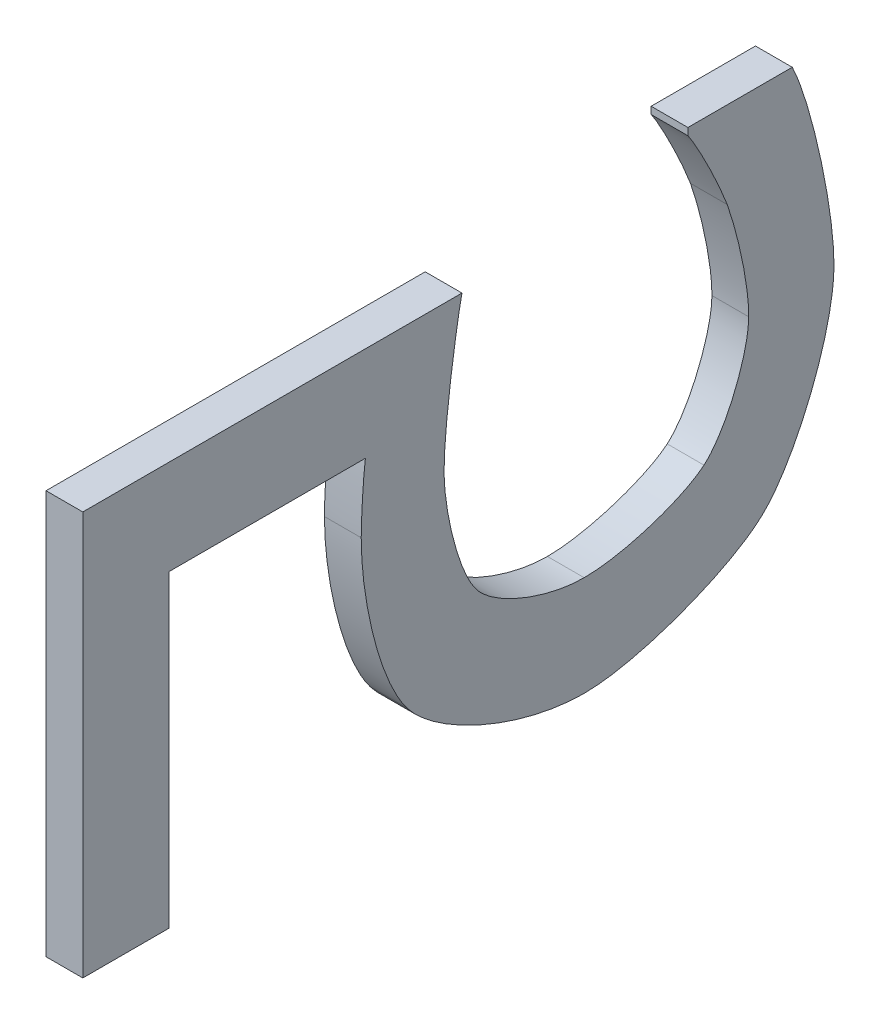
ISO-10303-21;
HEADER;
FILE_DESCRIPTION(('STEP AP214'),'2;1');
FILE_NAME('part.step','',(''),(''),'','','');
FILE_SCHEMA(('AUTOMOTIVE_DESIGN { 1 0 10303 214 1 1 1 1 }'));
ENDSEC;
DATA;
#1=APPLICATION_CONTEXT('core data for automotive mechanical design processes');
#2=APPLICATION_PROTOCOL_DEFINITION('international standard','automotive_design',2000,#1);
#3=PRODUCT_CONTEXT('',#1,'mechanical');
#4=PRODUCT('Part','Part','',(#3));
#5=PRODUCT_RELATED_PRODUCT_CATEGORY('part','',(#4));
#6=PRODUCT_DEFINITION_FORMATION('','',#4);
#7=PRODUCT_DEFINITION_CONTEXT('part definition',#1,'design');
#8=PRODUCT_DEFINITION('design','',#6,#7);
#9=PRODUCT_DEFINITION_SHAPE('','',#8);
#10=(LENGTH_UNIT() NAMED_UNIT(*) SI_UNIT(.MILLI.,.METRE.));
#11=(NAMED_UNIT(*) PLANE_ANGLE_UNIT() SI_UNIT($,.RADIAN.));
#12=(NAMED_UNIT(*) SI_UNIT($,.STERADIAN.) SOLID_ANGLE_UNIT());
#13=UNCERTAINTY_MEASURE_WITH_UNIT(LENGTH_MEASURE(1.E-05),#10,'distance_accuracy_value','');
#14=(GEOMETRIC_REPRESENTATION_CONTEXT(3) GLOBAL_UNCERTAINTY_ASSIGNED_CONTEXT((#13)) GLOBAL_UNIT_ASSIGNED_CONTEXT((#10,
#11,#12)) REPRESENTATION_CONTEXT('',''));
#15=CARTESIAN_POINT('',(0.,0.,0.));
#16=DIRECTION('',(0.,0.,1.));
#17=DIRECTION('',(1.,0.,0.));
#18=AXIS2_PLACEMENT_3D('',#15,#16,#17);
#19=CARTESIAN_POINT('',(-14.0348633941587,1.58473913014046,-0.050000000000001));
#20=DIRECTION('',(-1.,0.,0.));
#21=DIRECTION('',(0.,0.,1.));
#22=AXIS2_PLACEMENT_3D('',#19,#20,#21);
#23=PLANE('',#22);
#24=CARTESIAN_POINT('',(-14.0348633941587,-0.546472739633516,-5.75798091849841));
#25=CARTESIAN_POINT('',(-14.0348633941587,-0.546466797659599,-5.76539832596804));
#26=CARTESIAN_POINT('',(-14.0348633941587,-0.546229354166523,-5.77281035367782));
#27=CARTESIAN_POINT('',(-14.0348633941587,-0.545372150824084,-5.78760692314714));
#28=CARTESIAN_POINT('',(-14.0348633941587,-0.544752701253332,-5.79499148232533));
#29=CARTESIAN_POINT('',(-14.0348633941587,-0.542445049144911,-5.81706302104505));
#30=CARTESIAN_POINT('',(-14.0348633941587,-0.54030677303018,-5.83170208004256));
#31=CARTESIAN_POINT('',(-14.0348633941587,-0.535159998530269,-5.86083748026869));
#32=CARTESIAN_POINT('',(-14.0348633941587,-0.532150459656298,-5.8753336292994));
#33=CARTESIAN_POINT('',(-14.0348633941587,-0.52543253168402,-5.90417261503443));
#34=CARTESIAN_POINT('',(-14.0348633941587,-0.521723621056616,-5.91851532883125));
#35=CARTESIAN_POINT('',(-14.0348633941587,-0.510135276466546,-5.95976963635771));
#36=CARTESIAN_POINT('',(-14.0348633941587,-0.50148935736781,-5.98646699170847));
#37=CARTESIAN_POINT('',(-14.0348633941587,-0.482331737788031,-6.03916532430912));
#38=CARTESIAN_POINT('',(-14.0348633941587,-0.471821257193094,-6.06516674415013));
#39=CARTESIAN_POINT('',(-14.0348633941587,-0.454276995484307,-6.10394681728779));
#40=CARTESIAN_POINT('',(-14.0348633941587,-0.448002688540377,-6.11706981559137));
#41=CARTESIAN_POINT('',(-14.0348633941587,-0.434803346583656,-6.14296836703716));
#42=CARTESIAN_POINT('',(-14.0348633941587,-0.427879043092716,-6.15574429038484));
#43=CARTESIAN_POINT('',(-14.0348633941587,-0.413195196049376,-6.18084228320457));
#44=CARTESIAN_POINT('',(-14.0348633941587,-0.405434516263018,-6.19316370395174));
#45=CARTESIAN_POINT('',(-14.0348633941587,-0.392902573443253,-6.21105946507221));
#46=CARTESIAN_POINT('',(-14.0348633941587,-0.388568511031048,-6.21693663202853));
#47=CARTESIAN_POINT('',(-14.0348633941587,-0.37950716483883,-6.22839239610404));
#48=CARTESIAN_POINT('',(-14.0348633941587,-0.374779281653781,-6.2339705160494));
#49=CARTESIAN_POINT('',(-14.0348633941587,-0.369811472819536,-6.23934235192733));
#50=B_SPLINE_CURVE_WITH_KNOTS('',3,(#24,#25,#26,#27,#28,#29,#30,#31,#32,#33,#34,#35,#36,#37,#38,
#39,#40,#41,#42,#43,#44,#45,#46,#47,#48,#49),.UNSPECIFIED.,.F.,.F.,(4,2,2,2,2,2,2,2,2,2,2,2,4),
(0.,0.0222408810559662,0.0444637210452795,0.0888070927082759,0.133203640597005,
0.177633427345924,0.261741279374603,0.34579430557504,0.389417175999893,0.43299152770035,
0.476625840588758,0.498518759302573,0.520445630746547),.UNSPECIFIED.);
#51=CARTESIAN_POINT('',(-14.0348633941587,-0.546472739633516,-5.75798091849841));
#52=VERTEX_POINT('',#51);
#53=CARTESIAN_POINT('',(-14.0348633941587,-0.369811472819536,-6.23934235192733));
#54=VERTEX_POINT('',#53);
#55=EDGE_CURVE('E233',#52,#54,#50,.T.);
#56=ORIENTED_EDGE('',*,*,#55,.T.);
#57=CARTESIAN_POINT('',(-14.0348633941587,-0.369811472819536,-6.23934235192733));
#58=CARTESIAN_POINT('',(-14.0348633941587,-0.366162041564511,-6.24326393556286));
#59=CARTESIAN_POINT('',(-14.0348633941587,-0.362371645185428,-6.24704680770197));
#60=CARTESIAN_POINT('',(-14.0348633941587,-0.354574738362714,-6.25437457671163));
#61=CARTESIAN_POINT('',(-14.0348633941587,-0.350568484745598,-6.25791974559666));
#62=CARTESIAN_POINT('',(-14.0348633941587,-0.338338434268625,-6.26824777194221));
#63=CARTESIAN_POINT('',(-14.0348633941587,-0.329878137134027,-6.27474876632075));
#64=CARTESIAN_POINT('',(-14.0348633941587,-0.312554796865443,-6.28719458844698));
#65=CARTESIAN_POINT('',(-14.0348633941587,-0.303691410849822,-6.29313892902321));
#66=CARTESIAN_POINT('',(-14.0348633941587,-0.285669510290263,-6.30458326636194));
#67=CARTESIAN_POINT('',(-14.0348633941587,-0.276510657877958,-6.31008272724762));
#68=CARTESIAN_POINT('',(-14.0348633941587,-0.246792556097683,-6.32711558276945));
#69=CARTESIAN_POINT('',(-14.0348633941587,-0.225815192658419,-6.33792065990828));
#70=CARTESIAN_POINT('',(-14.0348633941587,-0.183169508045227,-6.3580560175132));
#71=CARTESIAN_POINT('',(-14.0348633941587,-0.161500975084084,-6.36738584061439));
#72=CARTESIAN_POINT('',(-14.0348633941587,-0.117567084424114,-6.38465042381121));
#73=CARTESIAN_POINT('',(-14.0348633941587,-0.095300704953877,-6.39258259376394));
#74=CARTESIAN_POINT('',(-14.0348633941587,-0.0502837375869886,-6.40689732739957));
#75=CARTESIAN_POINT('',(-14.0348633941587,-0.0275333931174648,-6.41328065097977));
#76=CARTESIAN_POINT('',(-14.0348633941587,0.0161303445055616,-6.42356480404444));
#77=CARTESIAN_POINT('',(-14.0348633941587,0.0369982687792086,-6.42765078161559));
#78=CARTESIAN_POINT('',(-14.0348633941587,0.0684962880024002,-6.43209522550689));
#79=CARTESIAN_POINT('',(-14.0348633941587,0.0790045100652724,-6.4332951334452));
#80=CARTESIAN_POINT('',(-14.0348633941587,0.100094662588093,-6.4349665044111));
#81=CARTESIAN_POINT('',(-14.0348633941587,0.110676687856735,-6.4354367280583));
#82=CARTESIAN_POINT('',(-14.0348633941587,0.121274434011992,-6.43545256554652));
#83=B_SPLINE_CURVE_WITH_KNOTS('',3,(#57,#58,#59,#60,#61,#62,#63,#64,#65,#66,#67,#68,#69,#70,#71,
#72,#73,#74,#75,#76,#77,#78,#79,#80,#81,#82),.UNSPECIFIED.,.F.,.F.,(4,2,2,2,2,2,2,2,2,2,2,2,4),
(0.,0.0160591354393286,0.032099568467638,0.0640731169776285,0.0960743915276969,0.12811365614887,
0.198821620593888,0.26955146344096,0.340411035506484,0.411235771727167,0.474934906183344,
0.506642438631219,0.538403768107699),.UNSPECIFIED.);
#84=CARTESIAN_POINT('',(-14.0348633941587,0.121274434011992,-6.43545256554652));
#85=VERTEX_POINT('',#84);
#86=EDGE_CURVE('E227',#54,#85,#83,.T.);
#87=ORIENTED_EDGE('',*,*,#86,.T.);
#88=CARTESIAN_POINT('',(-14.0348633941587,0.121274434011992,-6.43545256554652));
#89=CARTESIAN_POINT('',(-14.0348633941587,0.129678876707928,-6.4354429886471));
#90=CARTESIAN_POINT('',(-14.0348633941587,0.138079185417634,-6.43523483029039));
#91=CARTESIAN_POINT('',(-14.0348633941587,0.154862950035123,-6.43450687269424));
#92=CARTESIAN_POINT('',(-14.0348633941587,0.163246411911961,-6.43398721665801));
#93=CARTESIAN_POINT('',(-14.0348633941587,0.188352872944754,-6.43209013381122));
#94=CARTESIAN_POINT('',(-14.0348633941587,0.205049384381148,-6.43037421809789));
#95=CARTESIAN_POINT('',(-14.0348633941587,0.23837464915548,-6.42633113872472));
#96=CARTESIAN_POINT('',(-14.0348633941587,0.255003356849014,-6.42400361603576));
#97=CARTESIAN_POINT('',(-14.0348633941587,0.288191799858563,-6.41887076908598));
#98=CARTESIAN_POINT('',(-14.0348633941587,0.304751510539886,-6.41606528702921));
#99=CARTESIAN_POINT('',(-14.0348633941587,0.348737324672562,-6.4080582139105));
#100=CARTESIAN_POINT('',(-14.0348633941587,0.376098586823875,-6.40250002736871));
#101=CARTESIAN_POINT('',(-14.0348633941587,0.430586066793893,-6.39036617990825));
#102=CARTESIAN_POINT('',(-14.0348633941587,0.457712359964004,-6.38379085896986));
#103=CARTESIAN_POINT('',(-14.0348633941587,0.498315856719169,-6.37299380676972));
#104=CARTESIAN_POINT('',(-14.0348633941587,0.511911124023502,-6.36921552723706));
#105=CARTESIAN_POINT('',(-14.0348633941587,0.538987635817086,-6.36128886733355));
#106=CARTESIAN_POINT('',(-14.0348633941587,0.552468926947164,-6.35714064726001));
#107=CARTESIAN_POINT('',(-14.0348633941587,0.57928174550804,-6.34834998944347));
#108=CARTESIAN_POINT('',(-14.0348633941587,0.592613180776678,-6.34370726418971));
#109=CARTESIAN_POINT('',(-14.0348633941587,0.612400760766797,-6.33615895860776));
#110=CARTESIAN_POINT('',(-14.0348633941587,0.618965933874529,-6.33354357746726));
#111=CARTESIAN_POINT('',(-14.0348633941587,0.631975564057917,-6.32801781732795));
#112=CARTESIAN_POINT('',(-14.0348633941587,0.638419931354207,-6.32510722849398));
#113=CARTESIAN_POINT('',(-14.0348633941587,0.644775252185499,-6.32200037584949));
#114=B_SPLINE_CURVE_WITH_KNOTS('',3,(#88,#89,#90,#91,#92,#93,#94,#95,#96,#97,#98,#99,#100,#101,
#102,#103,#104,#105,#106,#107,#108,#109,#110,#111,#112,#113),.UNSPECIFIED.,.F.,.F.,(4,2,2,2,2,2,
2,2,2,2,2,2,4),(0.,0.0252052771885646,0.0503989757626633,0.10073413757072,0.15109891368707,
0.201480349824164,0.2852197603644,0.36893124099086,0.411258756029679,0.453568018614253,
0.495902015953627,0.517096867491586,0.538306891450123),.UNSPECIFIED.);
#115=CARTESIAN_POINT('',(-14.0348633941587,0.644775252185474,-6.32200037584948));
#116=VERTEX_POINT('',#115);
#117=EDGE_CURVE('E220',#85,#116,#114,.T.);
#118=ORIENTED_EDGE('',*,*,#117,.T.);
#119=DIRECTION('',(0.,0.,-1.));
#120=VECTOR('',#119,1.);
#121=CARTESIAN_POINT('',(-14.0348633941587,0.644775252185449,-6.03836990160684));
#122=LINE('',#121,#120);
#123=CARTESIAN_POINT('',(-14.0348633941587,0.644775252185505,-6.03836990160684));
#124=VERTEX_POINT('',#123);
#125=EDGE_CURVE('E512',#116,#124,#122,.F.);
#126=ORIENTED_EDGE('',*,*,#125,.T.);
#127=DIRECTION('',(0.,1.,0.));
#128=VECTOR('',#127,1.);
#129=CARTESIAN_POINT('',(-14.0348633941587,0.625326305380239,-6.03836990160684));
#130=LINE('',#129,#128);
#131=CARTESIAN_POINT('',(-14.0348633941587,0.625326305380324,-6.03836990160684));
#132=VERTEX_POINT('',#131);
#133=EDGE_CURVE('E508',#124,#132,#130,.F.);
#134=ORIENTED_EDGE('',*,*,#133,.T.);
#135=CARTESIAN_POINT('',(-14.0348633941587,0.625326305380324,-6.03836990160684));
#136=CARTESIAN_POINT('',(-14.0348633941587,0.62194559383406,-6.0408093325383));
#137=CARTESIAN_POINT('',(-14.0348633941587,0.618484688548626,-6.04312777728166));
#138=CARTESIAN_POINT('',(-14.0348633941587,0.611463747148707,-6.04760555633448));
#139=CARTESIAN_POINT('',(-14.0348633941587,0.607903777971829,-6.04976499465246));
#140=CARTESIAN_POINT('',(-14.0348633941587,0.597165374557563,-6.05613032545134));
#141=CARTESIAN_POINT('',(-14.0348633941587,0.589923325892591,-6.06022655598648));
#142=CARTESIAN_POINT('',(-14.0348633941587,0.57534944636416,-6.06824865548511));
#143=CARTESIAN_POINT('',(-14.0348633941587,0.568017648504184,-6.07217458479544));
#144=CARTESIAN_POINT('',(-14.0348633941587,0.553287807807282,-6.07990367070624));
#145=CARTESIAN_POINT('',(-14.0348633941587,0.545889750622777,-6.08370679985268));
#146=CARTESIAN_POINT('',(-14.0348633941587,0.527976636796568,-6.09275501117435));
#147=CARTESIAN_POINT('',(-14.0348633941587,0.517434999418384,-6.09794757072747));
#148=CARTESIAN_POINT('',(-14.0348633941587,0.49625208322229,-6.10812600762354));
#149=CARTESIAN_POINT('',(-14.0348633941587,0.485610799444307,-6.11311187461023));
#150=CARTESIAN_POINT('',(-14.0348633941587,0.464196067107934,-6.12286436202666));
#151=CARTESIAN_POINT('',(-14.0348633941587,0.453422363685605,-6.12763043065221));
#152=CARTESIAN_POINT('',(-14.0348633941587,0.431721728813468,-6.13679451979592));
#153=CARTESIAN_POINT('',(-14.0348633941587,0.420794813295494,-6.14119257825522));
#154=CARTESIAN_POINT('',(-14.0348633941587,0.409767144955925,-6.14533910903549));
#155=B_SPLINE_CURVE_WITH_KNOTS('',3,(#135,#136,#137,#138,#139,#140,#141,#142,#143,#144,#145,
#146,#147,#148,#149,#150,#151,#152,#153,#154),.UNSPECIFIED.,.F.,.F.,(4,2,2,2,2,2,2,2,2,4),(0.,
0.0124961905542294,0.0249841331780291,0.0499417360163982,0.0748904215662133,0.0998446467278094,
0.135095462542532,0.170348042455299,0.205684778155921,0.241017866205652),.UNSPECIFIED.);
#156=CARTESIAN_POINT('',(-14.0348633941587,0.409767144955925,-6.14533910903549));
#157=VERTEX_POINT('',#156);
#158=EDGE_CURVE('E213',#132,#157,#155,.T.);
#159=ORIENTED_EDGE('',*,*,#158,.T.);
#160=CARTESIAN_POINT('',(-14.0348633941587,0.409767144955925,-6.14533910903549));
#161=CARTESIAN_POINT('',(-14.0348633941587,0.401884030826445,-6.14806787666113));
#162=CARTESIAN_POINT('',(-14.0348633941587,0.393961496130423,-6.15067864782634));
#163=CARTESIAN_POINT('',(-14.0348633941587,0.378054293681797,-6.1557003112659));
#164=CARTESIAN_POINT('',(-14.0348633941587,0.370069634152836,-6.15811122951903));
#165=CARTESIAN_POINT('',(-14.0348633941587,0.346023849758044,-6.16510535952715));
#166=CARTESIAN_POINT('',(-14.0348633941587,0.32989125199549,-6.16944312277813));
#167=CARTESIAN_POINT('',(-14.0348633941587,0.297598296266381,-6.17750598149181));
#168=CARTESIAN_POINT('',(-14.0348633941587,0.281438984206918,-6.18123528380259));
#169=CARTESIAN_POINT('',(-14.0348633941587,0.249000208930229,-6.18806968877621));
#170=CARTESIAN_POINT('',(-14.0348633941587,0.232720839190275,-6.19117523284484));
#171=CARTESIAN_POINT('',(-14.0348633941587,0.199858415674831,-6.19663916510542));
#172=CARTESIAN_POINT('',(-14.0348633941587,0.183273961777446,-6.19898950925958));
#173=CARTESIAN_POINT('',(-14.0348633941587,0.158286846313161,-6.20161908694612));
#174=CARTESIAN_POINT('',(-14.0348633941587,0.149933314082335,-6.20234649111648));
#175=CARTESIAN_POINT('',(-14.0348633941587,0.133193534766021,-6.20337171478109));
#176=CARTESIAN_POINT('',(-14.0348633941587,0.124807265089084,-6.20366914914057));
#177=CARTESIAN_POINT('',(-14.0348633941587,0.1164121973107,-6.20368594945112));
#178=B_SPLINE_CURVE_WITH_KNOTS('',3,(#160,#161,#162,#163,#164,#165,#166,#167,#168,#169,#170,
#171,#172,#173,#174,#175,#176,#177),.UNSPECIFIED.,.F.,.F.,(4,2,2,2,2,2,2,2,4),(0.,
0.0250231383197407,0.0500430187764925,0.100147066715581,0.149888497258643,0.199594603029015,
0.24981383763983,0.274959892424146,0.300128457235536),.UNSPECIFIED.);
#179=CARTESIAN_POINT('',(-14.0348633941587,0.116412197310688,-6.20368594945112));
#180=VERTEX_POINT('',#179);
#181=EDGE_CURVE('E206',#157,#180,#178,.T.);
#182=ORIENTED_EDGE('',*,*,#181,.T.);
#183=CARTESIAN_POINT('',(-14.0348633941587,0.116412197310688,-6.20368594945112));
#184=CARTESIAN_POINT('',(-14.0348633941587,0.111780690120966,-6.20367905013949));
#185=CARTESIAN_POINT('',(-14.0348633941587,0.10715470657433,-6.20349656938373));
#186=CARTESIAN_POINT('',(-14.0348633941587,0.0979271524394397,-6.20285091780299));
#187=CARTESIAN_POINT('',(-14.0348633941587,0.0933255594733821,-6.20238807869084));
#188=CARTESIAN_POINT('',(-14.0348633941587,0.0795871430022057,-6.20068695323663));
#189=CARTESIAN_POINT('',(-14.0348633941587,0.0704902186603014,-6.19913521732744));
#190=CARTESIAN_POINT('',(-14.0348633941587,0.0523930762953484,-6.19544231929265));
#191=CARTESIAN_POINT('',(-14.0348633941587,0.0433932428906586,-6.19329935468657));
#192=CARTESIAN_POINT('',(-14.0348633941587,0.025511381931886,-6.1885416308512));
#193=CARTESIAN_POINT('',(-14.0348633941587,0.0166294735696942,-6.18592642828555));
#194=CARTESIAN_POINT('',(-14.0348633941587,-0.00831560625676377,-6.17795349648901));
#195=CARTESIAN_POINT('',(-14.0348633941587,-0.0242275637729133,-6.1721195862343));
#196=CARTESIAN_POINT('',(-14.0348633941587,-0.0555105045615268,-6.15920666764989));
#197=CARTESIAN_POINT('',(-14.0348633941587,-0.0708823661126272,-6.152129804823));
#198=CARTESIAN_POINT('',(-14.0348633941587,-0.0937630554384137,-6.14023159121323));
#199=CARTESIAN_POINT('',(-14.0348633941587,-0.101543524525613,-6.13593228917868));
#200=CARTESIAN_POINT('',(-14.0348633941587,-0.116815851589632,-6.12686943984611));
#201=CARTESIAN_POINT('',(-14.0348633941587,-0.124308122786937,-6.12210659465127));
#202=CARTESIAN_POINT('',(-14.0348633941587,-0.138925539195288,-6.11197945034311));
#203=CARTESIAN_POINT('',(-14.0348633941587,-0.146049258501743,-6.10661303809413));
#204=CARTESIAN_POINT('',(-14.0348633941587,-0.15625851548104,-6.09796331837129));
#205=CARTESIAN_POINT('',(-14.0348633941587,-0.159589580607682,-6.09497221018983));
#206=CARTESIAN_POINT('',(-14.0348633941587,-0.166024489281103,-6.08874483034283));
#207=CARTESIAN_POINT('',(-14.0348633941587,-0.169127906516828,-6.08550812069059));
#208=CARTESIAN_POINT('',(-14.0348633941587,-0.172080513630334,-6.0821300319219));
#209=B_SPLINE_CURVE_WITH_KNOTS('',3,(#183,#184,#185,#186,#187,#188,#189,#190,#191,#192,#193,
#194,#195,#196,#197,#198,#199,#200,#201,#202,#203,#204,#205,#206,#207,#208),.UNSPECIFIED.,.F.,
.F.,(4,2,2,2,2,2,2,2,2,2,2,2,4),(0.,0.0138834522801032,0.0277505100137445,0.0554055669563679,
0.0831458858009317,0.110912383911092,0.161699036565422,0.212398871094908,0.239053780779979,
0.265668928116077,0.292380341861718,0.305800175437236,0.319244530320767),.UNSPECIFIED.);
#210=CARTESIAN_POINT('',(-14.0348633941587,-0.172080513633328,-6.08213003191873));
#211=VERTEX_POINT('',#210);
#212=EDGE_CURVE('E199',#180,#211,#209,.T.);
#213=ORIENTED_EDGE('',*,*,#212,.T.);
#214=CARTESIAN_POINT('',(-14.0348633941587,-0.172080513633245,-6.08213003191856));
#215=CARTESIAN_POINT('',(-14.0348633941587,-0.17482373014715,-6.07884484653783));
#216=CARTESIAN_POINT('',(-14.0348633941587,-0.177432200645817,-6.0754543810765));
#217=CARTESIAN_POINT('',(-14.0348633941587,-0.182426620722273,-6.06851933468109));
#218=CARTESIAN_POINT('',(-14.0348633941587,-0.184812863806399,-6.06497496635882));
#219=CARTESIAN_POINT('',(-14.0348633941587,-0.191704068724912,-6.05420489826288));
#220=CARTESIAN_POINT('',(-14.0348633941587,-0.19595849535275,-6.04682044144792));
#221=CARTESIAN_POINT('',(-14.0348633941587,-0.20398004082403,-6.03182498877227));
#222=CARTESIAN_POINT('',(-14.0348633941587,-0.207748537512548,-6.02421471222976));
#223=CARTESIAN_POINT('',(-14.0348633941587,-0.214915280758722,-6.00881329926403));
#224=CARTESIAN_POINT('',(-14.0348633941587,-0.218313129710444,-6.0010219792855));
#225=CARTESIAN_POINT('',(-14.0348633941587,-0.229178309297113,-5.97469703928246));
#226=CARTESIAN_POINT('',(-14.0348633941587,-0.235941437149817,-5.95587193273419));
#227=CARTESIAN_POINT('',(-14.0348633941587,-0.248051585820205,-5.91773509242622));
#228=CARTESIAN_POINT('',(-14.0348633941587,-0.2533956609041,-5.89842243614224));
#229=CARTESIAN_POINT('',(-14.0348633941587,-0.26034173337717,-5.86886105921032));
#230=CARTESIAN_POINT('',(-14.0348633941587,-0.262503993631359,-5.85874290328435));
#231=CARTESIAN_POINT('',(-14.0348633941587,-0.266367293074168,-5.8384229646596));
#232=CARTESIAN_POINT('',(-14.0348633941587,-0.268068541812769,-5.82822122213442));
#233=CARTESIAN_POINT('',(-14.0348633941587,-0.270927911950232,-5.80777886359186));
#234=CARTESIAN_POINT('',(-14.0348633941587,-0.27208812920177,-5.79753855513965));
#235=CARTESIAN_POINT('',(-14.0348633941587,-0.273707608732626,-5.77699037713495));
#236=CARTESIAN_POINT('',(-14.0348633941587,-0.274165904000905,-5.76668243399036));
#237=CARTESIAN_POINT('',(-14.0348633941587,-0.274187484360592,-5.75636017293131));
#238=B_SPLINE_CURVE_WITH_KNOTS('',3,(#214,#215,#216,#217,#218,#219,#220,#221,#222,#223,#224,
#225,#226,#227,#228,#229,#230,#231,#232,#233,#234,#235,#236,#237),.UNSPECIFIED.,.F.,.F.,(4,2,2,
2,2,2,2,2,2,2,2,4),(0.,0.0128281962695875,0.0256392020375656,0.051178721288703,
0.0766441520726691,0.102136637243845,0.162071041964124,0.222128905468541,0.253159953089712,
0.284176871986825,0.3150726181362,0.346010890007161),.UNSPECIFIED.);
#239=CARTESIAN_POINT('',(-14.0348633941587,-0.274187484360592,-5.75636017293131));
#240=VERTEX_POINT('',#239);
#241=EDGE_CURVE('E192',#211,#240,#238,.T.);
#242=ORIENTED_EDGE('',*,*,#241,.T.);
#243=CARTESIAN_POINT('',(-14.0348633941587,-0.274187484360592,-5.75636017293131));
#244=CARTESIAN_POINT('',(-14.0348633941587,-0.2741679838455,-5.74519813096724));
#245=CARTESIAN_POINT('',(-14.0348633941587,-0.27355433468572,-5.73405731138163));
#246=CARTESIAN_POINT('',(-14.0348633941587,-0.271335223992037,-5.7118908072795));
#247=CARTESIAN_POINT('',(-14.0348633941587,-0.269731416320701,-5.70086496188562));
#248=CARTESIAN_POINT('',(-14.0348633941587,-0.265672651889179,-5.67866568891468));
#249=CARTESIAN_POINT('',(-14.0348633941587,-0.263195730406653,-5.66749640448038));
#250=CARTESIAN_POINT('',(-14.0348633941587,-0.257500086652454,-5.64534826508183));
#251=CARTESIAN_POINT('',(-14.0348633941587,-0.254281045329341,-5.63436949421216));
#252=CARTESIAN_POINT('',(-14.0348633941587,-0.243241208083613,-5.60061942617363));
#253=CARTESIAN_POINT('',(-14.0348633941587,-0.234262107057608,-5.57820338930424));
#254=CARTESIAN_POINT('',(-14.0348633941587,-0.218457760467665,-5.54590678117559));
#255=CARTESIAN_POINT('',(-14.0348633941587,-0.212841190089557,-5.53542192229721));
#256=CARTESIAN_POINT('',(-14.0348633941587,-0.200653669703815,-5.51502743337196));
#257=CARTESIAN_POINT('',(-14.0348633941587,-0.194084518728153,-5.50511676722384));
#258=CARTESIAN_POINT('',(-14.0348633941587,-0.182981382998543,-5.49065778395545));
#259=CARTESIAN_POINT('',(-14.0348633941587,-0.178918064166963,-5.48575569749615));
#260=CARTESIAN_POINT('',(-14.0348633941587,-0.170258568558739,-5.47640949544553));
#261=CARTESIAN_POINT('',(-14.0348633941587,-0.165659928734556,-5.47196768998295));
#262=CARTESIAN_POINT('',(-14.0348633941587,-0.16073529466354,-5.46786746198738));
#263=B_SPLINE_CURVE_WITH_KNOTS('',3,(#243,#244,#245,#246,#247,#248,#249,#250,#251,#252,#253,
#254,#255,#256,#257,#258,#259,#260,#261,#262),.UNSPECIFIED.,.F.,.F.,(4,2,2,2,2,2,2,2,2,4),(0.,
0.0334408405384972,0.0668259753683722,0.101119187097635,0.135427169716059,0.207592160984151,
0.243246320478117,0.278834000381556,0.297903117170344,0.317063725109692),.UNSPECIFIED.);
#264=CARTESIAN_POINT('',(-14.0348633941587,-0.16073529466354,-5.46786746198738));
#265=VERTEX_POINT('',#264);
#266=EDGE_CURVE('E152',#240,#265,#263,.T.);
#267=ORIENTED_EDGE('',*,*,#266,.T.);
#268=CARTESIAN_POINT('',(-14.0348633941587,-0.16073529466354,-5.46786746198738));
#269=CARTESIAN_POINT('',(-14.0348633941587,-0.156636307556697,-5.46427265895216));
#270=CARTESIAN_POINT('',(-14.0348633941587,-0.152317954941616,-5.46095979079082));
#271=CARTESIAN_POINT('',(-14.0348633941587,-0.143392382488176,-5.45478055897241));
#272=CARTESIAN_POINT('',(-14.0348633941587,-0.138786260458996,-5.45191262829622));
#273=CARTESIAN_POINT('',(-14.0348633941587,-0.129433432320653,-5.44649914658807));
#274=CARTESIAN_POINT('',(-14.0348633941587,-0.124687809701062,-5.44395165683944));
#275=CARTESIAN_POINT('',(-14.0348633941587,-0.115069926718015,-5.4390943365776));
#276=CARTESIAN_POINT('',(-14.0348633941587,-0.110197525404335,-5.43678478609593));
#277=CARTESIAN_POINT('',(-14.0348633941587,-0.0883365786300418,-5.42692803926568));
#278=CARTESIAN_POINT('',(-14.0348633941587,-0.0708906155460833,-5.42040162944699));
#279=CARTESIAN_POINT('',(-14.0348633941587,-0.0354383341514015,-5.40870263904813));
#280=CARTESIAN_POINT('',(-14.0348633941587,-0.0174288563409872,-5.40354028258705));
#281=CARTESIAN_POINT('',(-14.0348633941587,0.0144222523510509,-5.39552298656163));
#282=CARTESIAN_POINT('',(-14.0348633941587,0.0281996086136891,-5.39241281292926));
#283=CARTESIAN_POINT('',(-14.0348633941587,0.0558843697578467,-5.38686090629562));
#284=CARTESIAN_POINT('',(-14.0348633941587,0.0697917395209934,-5.38441899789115));
#285=CARTESIAN_POINT('',(-14.0348633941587,0.0974750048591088,-5.38031733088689));
#286=CARTESIAN_POINT('',(-14.0348633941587,0.111248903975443,-5.37864455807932));
#287=CARTESIAN_POINT('',(-14.0348633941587,0.131977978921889,-5.37683736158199));
#288=CARTESIAN_POINT('',(-14.0348633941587,0.138902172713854,-5.3763518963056));
#289=CARTESIAN_POINT('',(-14.0348633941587,0.152768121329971,-5.37567885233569));
#290=CARTESIAN_POINT('',(-14.0348633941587,0.159709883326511,-5.37549142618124));
#291=CARTESIAN_POINT('',(-14.0348633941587,0.166655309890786,-5.37548496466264));
#292=B_SPLINE_CURVE_WITH_KNOTS('',3,(#268,#269,#270,#271,#272,#273,#274,#275,#276,#277,#278,
#279,#280,#281,#282,#283,#284,#285,#286,#287,#288,#289,#290,#291),.UNSPECIFIED.,.F.,.F.,(4,2,2,
2,2,2,2,2,2,2,2,4),(0.,0.0163144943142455,0.032570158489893,0.0487221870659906,
0.0648930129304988,0.120655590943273,0.17682498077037,0.219180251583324,0.261524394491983,
0.303122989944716,0.323941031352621,0.344769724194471),.UNSPECIFIED.);
#293=CARTESIAN_POINT('',(-14.0348633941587,0.166655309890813,-5.37548496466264));
#294=VERTEX_POINT('',#293);
#295=EDGE_CURVE('E148',#265,#294,#292,.T.);
#296=ORIENTED_EDGE('',*,*,#295,.T.);
#297=CARTESIAN_POINT('',(-14.0348633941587,0.166655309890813,-5.37548496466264));
#298=CARTESIAN_POINT('',(-14.0348633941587,0.175032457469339,-5.37549794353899));
#299=CARTESIAN_POINT('',(-14.0348633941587,0.183406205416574,-5.37567865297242));
#300=CARTESIAN_POINT('',(-14.0348633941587,0.20014238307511,-5.376289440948));
#301=CARTESIAN_POINT('',(-14.0348633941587,0.208504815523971,-5.37671944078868));
#302=CARTESIAN_POINT('',(-14.0348633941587,0.233566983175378,-5.37825396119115));
#303=CARTESIAN_POINT('',(-14.0348633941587,0.250250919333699,-5.37960320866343));
#304=CARTESIAN_POINT('',(-14.0348633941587,0.28357315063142,-5.38270230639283));
#305=CARTESIAN_POINT('',(-14.0348633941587,0.300211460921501,-5.38445200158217));
#306=CARTESIAN_POINT('',(-14.0348633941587,0.333456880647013,-5.38824521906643));
#307=CARTESIAN_POINT('',(-14.0348633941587,0.350063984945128,-5.39028878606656));
#308=CARTESIAN_POINT('',(-14.0348633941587,0.383011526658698,-5.39458554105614));
#309=CARTESIAN_POINT('',(-14.0348633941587,0.399352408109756,-5.39683534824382));
#310=CARTESIAN_POINT('',(-14.0348633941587,0.4320035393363,-5.40155035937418));
#311=CARTESIAN_POINT('',(-14.0348633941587,0.448313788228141,-5.40401556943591));
#312=CARTESIAN_POINT('',(-14.0348633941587,0.480916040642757,-5.40918142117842));
#313=CARTESIAN_POINT('',(-14.0348633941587,0.497208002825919,-5.41188232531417));
#314=CARTESIAN_POINT('',(-14.0348633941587,0.521603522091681,-5.41617532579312));
#315=CARTESIAN_POINT('',(-14.0348633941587,0.529728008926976,-5.41764654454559));
#316=CARTESIAN_POINT('',(-14.0348633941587,0.545948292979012,-5.42074305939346));
#317=CARTESIAN_POINT('',(-14.0348633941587,0.554044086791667,-5.4223683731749));
#318=CARTESIAN_POINT('',(-14.0348633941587,0.562117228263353,-5.42410733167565));
#319=B_SPLINE_CURVE_WITH_KNOTS('',3,(#297,#298,#299,#300,#301,#302,#303,#304,#305,#306,#307,
#308,#309,#310,#311,#312,#313,#314,#315,#316,#317,#318),.UNSPECIFIED.,.F.,.F.,(4,2,2,2,2,2,2,2,
2,2,4),(0.,0.025125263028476,0.0502425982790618,0.100449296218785,0.150636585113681,
0.200831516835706,0.250315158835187,0.299800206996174,0.349341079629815,0.374109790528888,
0.398881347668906),.UNSPECIFIED.);
#320=CARTESIAN_POINT('',(-14.0348633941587,0.562117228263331,-5.42410733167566));
#321=VERTEX_POINT('',#320);
#322=EDGE_CURVE('E24',#294,#321,#319,.T.);
#323=ORIENTED_EDGE('',*,*,#322,.T.);
#324=DIRECTION('',(0.,0.,-1.));
#325=VECTOR('',#324,1.);
#326=CARTESIAN_POINT('',(-14.0348633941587,0.562117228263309,-4.39331315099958));
#327=LINE('',#326,#325);
#328=CARTESIAN_POINT('',(-14.0348633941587,0.562117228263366,-4.39331315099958));
#329=VERTEX_POINT('',#328);
#330=EDGE_CURVE('E569',#321,#329,#327,.F.);
#331=ORIENTED_EDGE('',*,*,#330,.T.);
#332=DIRECTION('',(0.,1.,0.));
#333=VECTOR('',#332,1.);
#334=CARTESIAN_POINT('',(-14.0348633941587,-0.535127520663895,-4.39331315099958));
#335=LINE('',#334,#333);
#336=CARTESIAN_POINT('',(-14.0348633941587,-0.535127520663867,-4.39331315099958));
#337=VERTEX_POINT('',#336);
#338=EDGE_CURVE('E559',#329,#337,#335,.F.);
#339=ORIENTED_EDGE('',*,*,#338,.T.);
#340=DIRECTION('',(0.,0.,1.));
#341=VECTOR('',#340,1.);
#342=CARTESIAN_POINT('',(-14.0348633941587,-0.535127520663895,-4.62832125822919));
#343=LINE('',#342,#341);
#344=CARTESIAN_POINT('',(-14.0348633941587,-0.535127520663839,-4.62832125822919));
#345=VERTEX_POINT('',#344);
#346=EDGE_CURVE('E549',#337,#345,#343,.F.);
#347=ORIENTED_EDGE('',*,*,#346,.T.);
#348=DIRECTION('',(0.,1.,0.));
#349=VECTOR('',#348,1.);
#350=CARTESIAN_POINT('',(-14.0348633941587,0.304418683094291,-4.62832125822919));
#351=LINE('',#350,#349);
#352=CARTESIAN_POINT('',(-14.0348633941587,0.304418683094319,-4.62832125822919));
#353=VERTEX_POINT('',#352);
#354=EDGE_CURVE('E538',#345,#353,#351,.T.);
#355=ORIENTED_EDGE('',*,*,#354,.T.);
#356=DIRECTION('',(0.,0.,1.));
#357=VECTOR('',#356,1.);
#358=CARTESIAN_POINT('',(-14.0348633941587,0.304418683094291,-5.16154654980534));
#359=LINE('',#358,#357);
#360=CARTESIAN_POINT('',(-14.0348633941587,0.304418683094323,-5.16154654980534));
#361=VERTEX_POINT('',#360);
#362=EDGE_CURVE('E534',#353,#361,#359,.F.);
#363=ORIENTED_EDGE('',*,*,#362,.T.);
#364=CARTESIAN_POINT('',(-14.0348633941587,0.304418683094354,-5.16154654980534));
#365=CARTESIAN_POINT('',(-14.0348633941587,0.296147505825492,-5.1604733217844));
#366=CARTESIAN_POINT('',(-14.0348633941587,0.287859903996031,-5.15954787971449));
#367=CARTESIAN_POINT('',(-14.0348633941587,0.271265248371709,-5.1579015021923));
#368=CARTESIAN_POINT('',(-14.0348633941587,0.262958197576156,-5.15718053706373));
#369=CARTESIAN_POINT('',(-14.0348633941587,0.246339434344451,-5.15585209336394));
#370=CARTESIAN_POINT('',(-14.0348633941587,0.238027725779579,-5.15524456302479));
#371=CARTESIAN_POINT('',(-14.0348633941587,0.22139720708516,-5.15412403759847));
#372=CARTESIAN_POINT('',(-14.0348633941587,0.213078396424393,-5.1536110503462));
#373=CARTESIAN_POINT('',(-14.0348633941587,0.191124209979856,-5.15236701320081));
#374=CARTESIAN_POINT('',(-14.0348633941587,0.177484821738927,-5.15170579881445));
#375=CARTESIAN_POINT('',(-14.0348633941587,0.157019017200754,-5.15091148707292));
#376=CARTESIAN_POINT('',(-14.0348633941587,0.150196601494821,-5.15067964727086));
#377=CARTESIAN_POINT('',(-14.0348633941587,0.136548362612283,-5.15033644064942));
#378=CARTESIAN_POINT('',(-14.0348633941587,0.129722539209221,-5.15022508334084));
#379=CARTESIAN_POINT('',(-14.0348633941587,0.122895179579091,-5.15020133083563));
#380=B_SPLINE_CURVE_WITH_KNOTS('',3,(#364,#365,#366,#367,#368,#369,#370,#371,#372,#373,#374,
#375,#376,#377,#378,#379),.UNSPECIFIED.,.F.,.F.,(4,2,2,2,2,2,2,4),(0.,0.0250163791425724,
0.0500291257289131,0.0750304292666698,0.100033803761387,0.140997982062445,0.161476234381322,
0.181956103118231),.UNSPECIFIED.);
#381=CARTESIAN_POINT('',(-14.0348633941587,0.122895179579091,-5.15020133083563));
#382=VERTEX_POINT('',#381);
#383=EDGE_CURVE('E243',#361,#382,#380,.T.);
#384=ORIENTED_EDGE('',*,*,#383,.T.);
#385=CARTESIAN_POINT('',(-14.0348633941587,0.122895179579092,-5.15020133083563));
#386=CARTESIAN_POINT('',(-14.0348633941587,0.106143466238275,-5.15022414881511));
#387=CARTESIAN_POINT('',(-14.0348633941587,0.0894025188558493,-5.15079330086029));
#388=CARTESIAN_POINT('',(-14.0348633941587,0.0559853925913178,-5.15286932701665));
#389=CARTESIAN_POINT('',(-14.0348633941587,0.0393091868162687,-5.15437575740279));
#390=CARTESIAN_POINT('',(-14.0348633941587,0.00593837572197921,-5.15818431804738));
#391=CARTESIAN_POINT('',(-14.0348633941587,-0.0107556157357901,-5.16049166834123));
#392=CARTESIAN_POINT('',(-14.0348633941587,-0.0440262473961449,-5.1658480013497));
#393=CARTESIAN_POINT('',(-14.0348633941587,-0.0606028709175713,-5.16889708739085));
#394=CARTESIAN_POINT('',(-14.0348633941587,-0.0999641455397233,-5.17704012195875));
#395=CARTESIAN_POINT('',(-14.0348633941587,-0.122680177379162,-5.18246931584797));
#396=CARTESIAN_POINT('',(-14.0348633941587,-0.167633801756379,-5.19483007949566));
#397=CARTESIAN_POINT('',(-14.0348633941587,-0.189872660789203,-5.20175693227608));
#398=CARTESIAN_POINT('',(-14.0348633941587,-0.223114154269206,-5.21369404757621));
#399=CARTESIAN_POINT('',(-14.0348633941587,-0.234363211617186,-5.21801751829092));
#400=CARTESIAN_POINT('',(-14.0348633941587,-0.256600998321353,-5.22726352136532));
#401=CARTESIAN_POINT('',(-14.0348633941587,-0.267589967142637,-5.23218547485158));
#402=CARTESIAN_POINT('',(-14.0348633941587,-0.289284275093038,-5.24279605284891));
#403=CARTESIAN_POINT('',(-14.0348633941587,-0.299987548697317,-5.248489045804));
#404=CARTESIAN_POINT('',(-14.0348633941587,-0.320819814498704,-5.26090473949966));
#405=CARTESIAN_POINT('',(-14.0348633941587,-0.330946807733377,-5.26763075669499));
#406=CARTESIAN_POINT('',(-14.0348633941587,-0.34063805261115,-5.27499873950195));
#407=B_SPLINE_CURVE_WITH_KNOTS('',3,(#385,#386,#387,#388,#389,#390,#391,#392,#393,#394,#395,
#396,#397,#398,#399,#400,#401,#402,#403,#404,#405,#406),.UNSPECIFIED.,.F.,.F.,(4,2,2,2,2,2,2,2,
2,2,4),(0.,0.0502316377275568,0.100439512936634,0.150980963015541,0.201529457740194,
0.271551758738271,0.341356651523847,0.377496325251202,0.413601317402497,0.449920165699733,
0.486358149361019),.UNSPECIFIED.);
#408=CARTESIAN_POINT('',(-14.0348633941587,-0.340638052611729,-5.27499873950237));
#409=VERTEX_POINT('',#408);
#410=EDGE_CURVE('E238',#382,#409,#407,.T.);
#411=ORIENTED_EDGE('',*,*,#410,.T.);
#412=CARTESIAN_POINT('',(-14.0348633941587,-0.340638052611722,-5.27499873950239));
#413=CARTESIAN_POINT('',(-14.0348633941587,-0.346665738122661,-5.27956233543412));
#414=CARTESIAN_POINT('',(-14.0348633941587,-0.352436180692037,-5.28443768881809));
#415=CARTESIAN_POINT('',(-14.0348633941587,-0.36352576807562,-5.29465182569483));
#416=CARTESIAN_POINT('',(-14.0348633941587,-0.368846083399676,-5.29998932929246));
#417=CARTESIAN_POINT('',(-14.0348633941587,-0.384220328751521,-5.31644051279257));
#418=CARTESIAN_POINT('',(-14.0348633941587,-0.393746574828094,-5.32804171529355));
#419=CARTESIAN_POINT('',(-14.0348633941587,-0.413436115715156,-5.35430859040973));
#420=CARTESIAN_POINT('',(-14.0348633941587,-0.4233763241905,-5.36913760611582));
#421=CARTESIAN_POINT('',(-14.0348633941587,-0.442038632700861,-5.39954140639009));
#422=CARTESIAN_POINT('',(-14.0348633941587,-0.450760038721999,-5.41511660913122));
#423=CARTESIAN_POINT('',(-14.0348633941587,-0.475479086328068,-5.46296295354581));
#424=CARTESIAN_POINT('',(-14.0348633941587,-0.489847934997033,-5.49609275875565));
#425=CARTESIAN_POINT('',(-14.0348633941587,-0.508792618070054,-5.54842844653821));
#426=CARTESIAN_POINT('',(-14.0348633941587,-0.514851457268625,-5.56712039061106));
#427=CARTESIAN_POINT('',(-14.0348633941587,-0.52558791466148,-5.60489106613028));
#428=CARTESIAN_POINT('',(-14.0348633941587,-0.530266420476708,-5.62396954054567));
#429=CARTESIAN_POINT('',(-14.0348633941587,-0.53797280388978,-5.66207869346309));
#430=CARTESIAN_POINT('',(-14.0348633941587,-0.541031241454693,-5.68110297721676));
#431=CARTESIAN_POINT('',(-14.0348633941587,-0.545265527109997,-5.7193966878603));
#432=CARTESIAN_POINT('',(-14.0348633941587,-0.546437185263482,-5.73866656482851));
#433=CARTESIAN_POINT('',(-14.0348633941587,-0.546472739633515,-5.75798091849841));
#434=B_SPLINE_CURVE_WITH_KNOTS('',3,(#412,#413,#414,#415,#416,#417,#418,#419,#420,#421,#422,
#423,#424,#425,#426,#427,#428,#429,#430,#431,#432,#433),.UNSPECIFIED.,.F.,.F.,(4,2,2,2,2,2,2,2,
2,2,4),(0.,0.0226455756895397,0.0452303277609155,0.0901721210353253,0.143656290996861,
0.197170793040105,0.305151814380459,0.364063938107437,0.422938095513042,0.480658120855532,
0.538506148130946),.UNSPECIFIED.);
#435=EDGE_CURVE('E181',#409,#52,#434,.T.);
#436=ORIENTED_EDGE('',*,*,#435,.T.);
#437=EDGE_LOOP('',(#56,#87,#118,#126,#134,#159,#182,#213,#242,#267,#296,#323,#331,#339,#347,
#355,#363,#384,#411,#436));
#438=FACE_BOUND('',#437,.T.);
#439=ADVANCED_FACE('F17',(#438),#23,.F.);
#440=CARTESIAN_POINT('',(-14.1348633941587,0.562117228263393,-5.42410733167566));
#441=CARTESIAN_POINT('',(-14.0348633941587,0.562117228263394,-5.42410733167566));
#442=CARTESIAN_POINT('',(-14.1348633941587,0.495666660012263,-5.40952062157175));
#443=CARTESIAN_POINT('',(-14.0348633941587,0.495666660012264,-5.40952062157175));
#444=CARTESIAN_POINT('',(-14.1348633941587,0.276866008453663,-5.37548496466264));
#445=CARTESIAN_POINT('',(-14.0348633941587,0.276866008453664,-5.37548496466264));
#446=CARTESIAN_POINT('',(-14.1348633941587,0.166655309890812,-5.37548496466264));
#447=CARTESIAN_POINT('',(-14.0348633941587,0.166655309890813,-5.37548496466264));
#448=B_SPLINE_SURFACE_WITH_KNOTS('',3,1,((#440,#441),(#442,#443),(#444,#445),(#446,#447)),
.UNSPECIFIED.,.F.,.F.,.F.,(4,4),(2,2),(0.,1.),(0.,0.01),.UNSPECIFIED.);
#449=DIRECTION('',(1.,0.,0.));
#450=VECTOR('',#449,1.);
#451=CARTESIAN_POINT('',(-39.7858458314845,0.562117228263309,-5.42410733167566));
#452=LINE('',#451,#450);
#453=CARTESIAN_POINT('',(-14.1348633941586,0.562117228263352,-5.42410733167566));
#454=VERTEX_POINT('',#453);
#455=EDGE_CURVE('E143',#454,#321,#452,.T.);
#456=DIRECTION('',(-1.,0.,0.));
#457=VECTOR('',#456,1.);
#458=CARTESIAN_POINT('',(-14.0848633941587,0.166655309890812,-5.37548496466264));
#459=LINE('',#458,#457);
#460=CARTESIAN_POINT('',(-14.1348633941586,0.166655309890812,-5.37548496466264));
#461=VERTEX_POINT('',#460);
#462=EDGE_CURVE('E142',#294,#461,#459,.T.);
#463=CARTESIAN_POINT('',(-14.1348633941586,0.166655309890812,-5.37548496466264));
#464=CARTESIAN_POINT('',(-14.1348633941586,0.175032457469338,-5.37549794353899));
#465=CARTESIAN_POINT('',(-14.1348633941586,0.183406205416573,-5.37567865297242));
#466=CARTESIAN_POINT('',(-14.1348633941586,0.200142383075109,-5.376289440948));
#467=CARTESIAN_POINT('',(-14.1348633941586,0.20850481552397,-5.37671944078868));
#468=CARTESIAN_POINT('',(-14.1348633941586,0.233566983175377,-5.37825396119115));
#469=CARTESIAN_POINT('',(-14.1348633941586,0.250250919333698,-5.37960320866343));
#470=CARTESIAN_POINT('',(-14.1348633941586,0.283573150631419,-5.38270230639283));
#471=CARTESIAN_POINT('',(-14.1348633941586,0.3002114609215,-5.38445200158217));
#472=CARTESIAN_POINT('',(-14.1348633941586,0.333456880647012,-5.38824521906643));
#473=CARTESIAN_POINT('',(-14.1348633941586,0.350063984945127,-5.39028878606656));
#474=CARTESIAN_POINT('',(-14.1348633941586,0.383011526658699,-5.39458554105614));
#475=CARTESIAN_POINT('',(-14.1348633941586,0.399352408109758,-5.39683534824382));
#476=CARTESIAN_POINT('',(-14.1348633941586,0.432003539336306,-5.40155035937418));
#477=CARTESIAN_POINT('',(-14.1348633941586,0.448313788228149,-5.40401556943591));
#478=CARTESIAN_POINT('',(-14.1348633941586,0.480916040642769,-5.40918142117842));
#479=CARTESIAN_POINT('',(-14.1348633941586,0.497208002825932,-5.41188232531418));
#480=CARTESIAN_POINT('',(-14.1348633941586,0.521603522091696,-5.41617532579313));
#481=CARTESIAN_POINT('',(-14.1348633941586,0.529728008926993,-5.41764654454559));
#482=CARTESIAN_POINT('',(-14.1348633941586,0.545948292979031,-5.42074305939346));
#483=CARTESIAN_POINT('',(-14.1348633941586,0.554044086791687,-5.4223683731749));
#484=CARTESIAN_POINT('',(-14.1348633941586,0.562117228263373,-5.42410733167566));
#485=B_SPLINE_CURVE_WITH_KNOTS('',3,(#463,#464,#465,#466,#467,#468,#469,#470,#471,#472,#473,
#474,#475,#476,#477,#478,#479,#480,#481,#482,#483,#484),.UNSPECIFIED.,.F.,.F.,(4,2,2,2,2,2,2,2,
2,2,4),(0.,0.025125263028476,0.0502425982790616,0.100449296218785,0.150636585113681,
0.200831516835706,0.250315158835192,0.299800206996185,0.349341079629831,0.374109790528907,
0.398881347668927),.UNSPECIFIED.);
#486=EDGE_CURVE('E149',#461,#454,#485,.T.);
#487=ORIENTED_EDGE('',*,*,#455,.T.);
#488=ORIENTED_EDGE('',*,*,#322,.F.);
#489=ORIENTED_EDGE('',*,*,#462,.T.);
#490=ORIENTED_EDGE('',*,*,#486,.T.);
#491=EDGE_LOOP('',(#487,#488,#489,#490));
#492=FACE_BOUND('',#491,.T.);
#493=ADVANCED_FACE('F140',(#492),#448,.F.);
#494=CARTESIAN_POINT('',(-39.7858458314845,0.562117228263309,-4.39331315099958));
#495=DIRECTION('',(0.,-1.,0.));
#496=DIRECTION('',(0.,0.,-1.));
#497=AXIS2_PLACEMENT_3D('',#494,#495,#496);
#498=PLANE('',#497);
#499=DIRECTION('',(-1.,0.,0.));
#500=VECTOR('',#499,1.);
#501=CARTESIAN_POINT('',(-39.7858458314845,0.562117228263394,-4.39331315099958));
#502=LINE('',#501,#500);
#503=CARTESIAN_POINT('',(-14.1348633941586,0.562117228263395,-4.39331315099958));
#504=VERTEX_POINT('',#503);
#505=EDGE_CURVE('E566',#504,#329,#502,.F.);
#506=ORIENTED_EDGE('',*,*,#505,.T.);
#507=ORIENTED_EDGE('',*,*,#330,.F.);
#508=ORIENTED_EDGE('',*,*,#455,.F.);
#509=DIRECTION('',(0.,0.,-1.));
#510=VECTOR('',#509,1.);
#511=CARTESIAN_POINT('',(-14.1348633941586,0.562117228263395,0.));
#512=LINE('',#511,#510);
#513=EDGE_CURVE('E493',#454,#504,#512,.F.);
#514=ORIENTED_EDGE('',*,*,#513,.T.);
#515=EDGE_LOOP('',(#506,#507,#508,#514));
#516=FACE_BOUND('',#515,.T.);
#517=ADVANCED_FACE('F172',(#516),#498,.F.);
#518=CARTESIAN_POINT('',(-39.7858458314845,-0.535127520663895,-4.39331315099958));
#519=DIRECTION('',(0.,0.,-1.));
#520=DIRECTION('',(-1.,0.,0.));
#521=AXIS2_PLACEMENT_3D('',#518,#519,#520);
#522=PLANE('',#521);
#523=DIRECTION('',(1.,0.,0.));
#524=VECTOR('',#523,1.);
#525=CARTESIAN_POINT('',(-39.7858458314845,-0.535127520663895,-4.39331315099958));
#526=LINE('',#525,#524);
#527=CARTESIAN_POINT('',(-14.1348633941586,-0.535127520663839,-4.39331315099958));
#528=VERTEX_POINT('',#527);
#529=EDGE_CURVE('E556',#528,#337,#526,.T.);
#530=ORIENTED_EDGE('',*,*,#529,.T.);
#531=ORIENTED_EDGE('',*,*,#338,.F.);
#532=ORIENTED_EDGE('',*,*,#505,.F.);
#533=DIRECTION('',(0.,1.,0.));
#534=VECTOR('',#533,1.);
#535=CARTESIAN_POINT('',(-14.1348633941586,1.58473913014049,-4.39331315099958));
#536=LINE('',#535,#534);
#537=EDGE_CURVE('E496',#504,#528,#536,.F.);
#538=ORIENTED_EDGE('',*,*,#537,.T.);
#539=EDGE_LOOP('',(#530,#531,#532,#538));
#540=FACE_BOUND('',#539,.T.);
#541=ADVANCED_FACE('F602',(#540),#522,.F.);
#542=CARTESIAN_POINT('',(-39.7858458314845,-0.535127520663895,-4.62832125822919));
#543=DIRECTION('',(0.,1.,0.));
#544=DIRECTION('',(0.,0.,1.));
#545=AXIS2_PLACEMENT_3D('',#542,#543,#544);
#546=PLANE('',#545);
#547=DIRECTION('',(1.,0.,0.));
#548=VECTOR('',#547,1.);
#549=CARTESIAN_POINT('',(-39.7858458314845,-0.535127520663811,-4.62832125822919));
#550=LINE('',#549,#548);
#551=CARTESIAN_POINT('',(-14.1348633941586,-0.535127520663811,-4.62832125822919));
#552=VERTEX_POINT('',#551);
#553=EDGE_CURVE('E546',#552,#345,#550,.T.);
#554=ORIENTED_EDGE('',*,*,#553,.T.);
#555=ORIENTED_EDGE('',*,*,#346,.F.);
#556=ORIENTED_EDGE('',*,*,#529,.F.);
#557=DIRECTION('',(0.,0.,-1.));
#558=VECTOR('',#557,1.);
#559=CARTESIAN_POINT('',(-14.1348633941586,-0.535127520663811,0.));
#560=LINE('',#559,#558);
#561=EDGE_CURVE('E543',#528,#552,#560,.T.);
#562=ORIENTED_EDGE('',*,*,#561,.T.);
#563=EDGE_LOOP('',(#554,#555,#556,#562));
#564=FACE_BOUND('',#563,.T.);
#565=ADVANCED_FACE('F648',(#564),#546,.F.);
#566=CARTESIAN_POINT('',(-39.7858458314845,0.304418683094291,-4.62832125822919));
#567=DIRECTION('',(0.,0.,1.));
#568=DIRECTION('',(1.,0.,0.));
#569=AXIS2_PLACEMENT_3D('',#566,#567,#568);
#570=PLANE('',#569);
#571=DIRECTION('',(1.,0.,0.));
#572=VECTOR('',#571,1.);
#573=CARTESIAN_POINT('',(-39.7858458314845,0.304418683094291,-4.62832125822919));
#574=LINE('',#573,#572);
#575=CARTESIAN_POINT('',(-14.1348633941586,0.304418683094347,-4.62832125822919));
#576=VERTEX_POINT('',#575);
#577=EDGE_CURVE('E535',#576,#353,#574,.T.);
#578=ORIENTED_EDGE('',*,*,#577,.T.);
#579=ORIENTED_EDGE('',*,*,#354,.F.);
#580=ORIENTED_EDGE('',*,*,#553,.F.);
#581=DIRECTION('',(0.,1.,0.));
#582=VECTOR('',#581,1.);
#583=CARTESIAN_POINT('',(-14.1348633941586,1.58473913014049,-4.62832125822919));
#584=LINE('',#583,#582);
#585=EDGE_CURVE('E490',#552,#576,#584,.T.);
#586=ORIENTED_EDGE('',*,*,#585,.T.);
#587=EDGE_LOOP('',(#578,#579,#580,#586));
#588=FACE_BOUND('',#587,.T.);
#589=ADVANCED_FACE('F647',(#588),#570,.F.);
#590=CARTESIAN_POINT('',(-39.7858458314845,0.304418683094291,-5.16154654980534));
#591=DIRECTION('',(0.,1.,0.));
#592=DIRECTION('',(0.,0.,1.));
#593=AXIS2_PLACEMENT_3D('',#590,#591,#592);
#594=PLANE('',#593);
#595=DIRECTION('',(1.,0.,0.));
#596=VECTOR('',#595,1.);
#597=CARTESIAN_POINT('',(-14.0848633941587,0.304418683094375,-5.16154654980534));
#598=LINE('',#597,#596);
#599=CARTESIAN_POINT('',(-14.1348633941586,0.304418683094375,-5.16154654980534));
#600=VERTEX_POINT('',#599);
#601=EDGE_CURVE('E248',#600,#361,#598,.T.);
#602=ORIENTED_EDGE('',*,*,#601,.T.);
#603=ORIENTED_EDGE('',*,*,#362,.F.);
#604=ORIENTED_EDGE('',*,*,#577,.F.);
#605=DIRECTION('',(0.,0.,-1.));
#606=VECTOR('',#605,1.);
#607=CARTESIAN_POINT('',(-14.1348633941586,0.304418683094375,0.));
#608=LINE('',#607,#606);
#609=EDGE_CURVE('E273',#576,#600,#608,.T.);
#610=ORIENTED_EDGE('',*,*,#609,.T.);
#611=EDGE_LOOP('',(#602,#603,#604,#610));
#612=FACE_BOUND('',#611,.T.);
#613=ADVANCED_FACE('F255',(#612),#594,.F.);
#614=CARTESIAN_POINT('',(-14.1348633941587,0.122895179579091,-5.15020133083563));
#615=CARTESIAN_POINT('',(-14.0348633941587,0.122895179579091,-5.15020133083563));
#616=CARTESIAN_POINT('',(-14.1348633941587,0.16179307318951,-5.15020133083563));
#617=CARTESIAN_POINT('',(-14.0348633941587,0.16179307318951,-5.15020133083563));
#618=CARTESIAN_POINT('',(-14.1348633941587,0.255796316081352,-5.15506356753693));
#619=CARTESIAN_POINT('',(-14.0348633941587,0.255796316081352,-5.15506356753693));
#620=CARTESIAN_POINT('',(-14.1348633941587,0.304418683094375,-5.16154654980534));
#621=CARTESIAN_POINT('',(-14.0348633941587,0.304418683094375,-5.16154654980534));
#622=B_SPLINE_SURFACE_WITH_KNOTS('',3,1,((#614,#615),(#616,#617),(#618,#619),(#620,#621)),
.UNSPECIFIED.,.F.,.F.,.F.,(4,4),(2,2),(0.,1.),(0.,0.01),.UNSPECIFIED.);
#623=DIRECTION('',(1.,0.,0.));
#624=VECTOR('',#623,1.);
#625=CARTESIAN_POINT('',(-14.0848633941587,0.122895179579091,-5.15020133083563));
#626=LINE('',#625,#624);
#627=CARTESIAN_POINT('',(-14.1348633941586,0.122895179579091,-5.15020133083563));
#628=VERTEX_POINT('',#627);
#629=EDGE_CURVE('E247',#628,#382,#626,.T.);
#630=CARTESIAN_POINT('',(-14.1348633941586,0.304418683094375,-5.16154654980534));
#631=CARTESIAN_POINT('',(-14.1348633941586,0.296147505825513,-5.1604733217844));
#632=CARTESIAN_POINT('',(-14.1348633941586,0.287859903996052,-5.15954787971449));
#633=CARTESIAN_POINT('',(-14.1348633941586,0.27126524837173,-5.15790150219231));
#634=CARTESIAN_POINT('',(-14.1348633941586,0.262958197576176,-5.15718053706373));
#635=CARTESIAN_POINT('',(-14.1348633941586,0.246339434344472,-5.15585209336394));
#636=CARTESIAN_POINT('',(-14.1348633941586,0.2380277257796,-5.15524456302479));
#637=CARTESIAN_POINT('',(-14.1348633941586,0.221397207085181,-5.15412403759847));
#638=CARTESIAN_POINT('',(-14.1348633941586,0.213078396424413,-5.1536110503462));
#639=CARTESIAN_POINT('',(-14.1348633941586,0.191124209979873,-5.15236701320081));
#640=CARTESIAN_POINT('',(-14.1348633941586,0.177484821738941,-5.15170579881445));
#641=CARTESIAN_POINT('',(-14.1348633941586,0.157019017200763,-5.15091148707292));
#642=CARTESIAN_POINT('',(-14.1348633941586,0.150196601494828,-5.15067964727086));
#643=CARTESIAN_POINT('',(-14.1348633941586,0.136548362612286,-5.15033644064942));
#644=CARTESIAN_POINT('',(-14.1348633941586,0.129722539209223,-5.15022508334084));
#645=CARTESIAN_POINT('',(-14.1348633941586,0.122895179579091,-5.15020133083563));
#646=B_SPLINE_CURVE_WITH_KNOTS('',3,(#630,#631,#632,#633,#634,#635,#636,#637,#638,#639,#640,
#641,#642,#643,#644,#645),.UNSPECIFIED.,.F.,.F.,(4,2,2,2,2,2,2,4),(0.,0.0250163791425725,
0.0500291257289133,0.0750304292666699,0.100033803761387,0.140997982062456,0.161476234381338,
0.181956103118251),.UNSPECIFIED.);
#647=EDGE_CURVE('E266',#600,#628,#646,.T.);
#648=ORIENTED_EDGE('',*,*,#629,.T.);
#649=ORIENTED_EDGE('',*,*,#383,.F.);
#650=ORIENTED_EDGE('',*,*,#601,.F.);
#651=ORIENTED_EDGE('',*,*,#647,.T.);
#652=EDGE_LOOP('',(#648,#649,#650,#651));
#653=FACE_BOUND('',#652,.T.);
#654=ADVANCED_FACE('F249',(#653),#622,.F.);
#655=CARTESIAN_POINT('',(-14.1348633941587,-0.340638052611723,-5.27499873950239));
#656=CARTESIAN_POINT('',(-14.0348633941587,-0.340638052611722,-5.27499873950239));
#657=CARTESIAN_POINT('',(-14.1348633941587,-0.243393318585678,-5.20044444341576));
#658=CARTESIAN_POINT('',(-14.0348633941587,-0.243393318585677,-5.20044444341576));
#659=CARTESIAN_POINT('',(-14.1348633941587,-0.031075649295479,-5.15020133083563));
#660=CARTESIAN_POINT('',(-14.0348633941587,-0.031075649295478,-5.15020133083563));
#661=CARTESIAN_POINT('',(-14.1348633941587,0.122895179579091,-5.15020133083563));
#662=CARTESIAN_POINT('',(-14.0348633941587,0.122895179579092,-5.15020133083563));
#663=B_SPLINE_SURFACE_WITH_KNOTS('',3,1,((#655,#656),(#657,#658),(#659,#660),(#661,#662)),
.UNSPECIFIED.,.F.,.F.,.F.,(4,4),(2,2),(0.,1.),(0.,0.01),.UNSPECIFIED.);
#664=DIRECTION('',(1.,0.,0.));
#665=VECTOR('',#664,1.);
#666=CARTESIAN_POINT('',(-14.0848633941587,-0.340638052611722,-5.27499873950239));
#667=LINE('',#666,#665);
#668=CARTESIAN_POINT('',(-14.1348633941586,-0.340638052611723,-5.27499873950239));
#669=VERTEX_POINT('',#668);
#670=EDGE_CURVE('E527',#669,#409,#667,.T.);
#671=CARTESIAN_POINT('',(-14.1348633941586,0.122895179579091,-5.15020133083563));
#672=CARTESIAN_POINT('',(-14.1348633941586,0.106143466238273,-5.15022414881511));
#673=CARTESIAN_POINT('',(-14.1348633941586,0.0894025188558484,-5.15079330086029));
#674=CARTESIAN_POINT('',(-14.1348633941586,0.0559853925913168,-5.15286932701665));
#675=CARTESIAN_POINT('',(-14.1348633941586,0.0393091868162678,-5.15437575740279));
#676=CARTESIAN_POINT('',(-14.1348633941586,0.00593837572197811,-5.15818431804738));
#677=CARTESIAN_POINT('',(-14.1348633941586,-0.0107556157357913,-5.16049166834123));
#678=CARTESIAN_POINT('',(-14.1348633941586,-0.0440262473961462,-5.1658480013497));
#679=CARTESIAN_POINT('',(-14.1348633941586,-0.0606028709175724,-5.16889708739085));
#680=CARTESIAN_POINT('',(-14.1348633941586,-0.0999641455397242,-5.17704012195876));
#681=CARTESIAN_POINT('',(-14.1348633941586,-0.122680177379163,-5.18246931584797));
#682=CARTESIAN_POINT('',(-14.1348633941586,-0.16763380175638,-5.19483007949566));
#683=CARTESIAN_POINT('',(-14.1348633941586,-0.189872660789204,-5.20175693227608));
#684=CARTESIAN_POINT('',(-14.1348633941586,-0.223114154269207,-5.21369404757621));
#685=CARTESIAN_POINT('',(-14.1348633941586,-0.234363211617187,-5.21801751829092));
#686=CARTESIAN_POINT('',(-14.1348633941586,-0.256600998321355,-5.22726352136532));
#687=CARTESIAN_POINT('',(-14.1348633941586,-0.267589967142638,-5.23218547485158));
#688=CARTESIAN_POINT('',(-14.1348633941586,-0.289284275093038,-5.24279605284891));
#689=CARTESIAN_POINT('',(-14.1348633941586,-0.299987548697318,-5.248489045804));
#690=CARTESIAN_POINT('',(-14.1348633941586,-0.320819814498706,-5.26090473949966));
#691=CARTESIAN_POINT('',(-14.1348633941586,-0.330946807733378,-5.26763075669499));
#692=CARTESIAN_POINT('',(-14.1348633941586,-0.340638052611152,-5.27499873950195));
#693=B_SPLINE_CURVE_WITH_KNOTS('',3,(#671,#672,#673,#674,#675,#676,#677,#678,#679,#680,#681,
#682,#683,#684,#685,#686,#687,#688,#689,#690,#691,#692),.UNSPECIFIED.,.F.,.F.,(4,2,2,2,2,2,2,2,
2,2,4),(0.,0.0502316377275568,0.100439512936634,0.150980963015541,0.201529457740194,
0.271551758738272,0.341356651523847,0.377496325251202,0.413601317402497,0.449920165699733,
0.486358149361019),.UNSPECIFIED.);
#694=EDGE_CURVE('E272',#628,#669,#693,.T.);
#695=ORIENTED_EDGE('',*,*,#670,.T.);
#696=ORIENTED_EDGE('',*,*,#410,.F.);
#697=ORIENTED_EDGE('',*,*,#629,.F.);
#698=ORIENTED_EDGE('',*,*,#694,.T.);
#699=EDGE_LOOP('',(#695,#696,#697,#698));
#700=FACE_BOUND('',#699,.T.);
#701=ADVANCED_FACE('F254',(#700),#663,.F.);
#702=CARTESIAN_POINT('',(-14.1348633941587,-0.546472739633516,-5.75798091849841));
#703=CARTESIAN_POINT('',(-14.0348633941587,-0.546472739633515,-5.75798091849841));
#704=CARTESIAN_POINT('',(-14.1348633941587,-0.546472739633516,-5.57645741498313));
#705=CARTESIAN_POINT('',(-14.0348633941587,-0.546472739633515,-5.57645741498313));
#706=CARTESIAN_POINT('',(-14.1348633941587,-0.439503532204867,-5.34955303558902));
#707=CARTESIAN_POINT('',(-14.0348633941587,-0.439503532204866,-5.34955303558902));
#708=CARTESIAN_POINT('',(-14.1348633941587,-0.340638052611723,-5.27499873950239));
#709=CARTESIAN_POINT('',(-14.0348633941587,-0.340638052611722,-5.27499873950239));
#710=B_SPLINE_SURFACE_WITH_KNOTS('',3,1,((#702,#703),(#704,#705),(#706,#707),(#708,#709)),
.UNSPECIFIED.,.F.,.F.,.F.,(4,4),(2,2),(0.,1.),(0.,0.01),.UNSPECIFIED.);
#711=DIRECTION('',(1.,0.,0.));
#712=VECTOR('',#711,1.);
#713=CARTESIAN_POINT('',(-14.0848633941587,-0.546472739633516,-5.75798091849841));
#714=LINE('',#713,#712);
#715=CARTESIAN_POINT('',(-14.1348633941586,-0.546472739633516,-5.75798091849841));
#716=VERTEX_POINT('',#715);
#717=EDGE_CURVE('E524',#716,#52,#714,.T.);
#718=CARTESIAN_POINT('',(-14.1348633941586,-0.340638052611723,-5.27499873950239));
#719=CARTESIAN_POINT('',(-14.1348633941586,-0.346665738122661,-5.27956233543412));
#720=CARTESIAN_POINT('',(-14.1348633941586,-0.352436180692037,-5.28443768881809));
#721=CARTESIAN_POINT('',(-14.1348633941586,-0.363525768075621,-5.29465182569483));
#722=CARTESIAN_POINT('',(-14.1348633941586,-0.368846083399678,-5.29998932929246));
#723=CARTESIAN_POINT('',(-14.1348633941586,-0.384220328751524,-5.31644051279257));
#724=CARTESIAN_POINT('',(-14.1348633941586,-0.393746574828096,-5.32804171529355));
#725=CARTESIAN_POINT('',(-14.1348633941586,-0.413436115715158,-5.35430859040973));
#726=CARTESIAN_POINT('',(-14.1348633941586,-0.423376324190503,-5.36913760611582));
#727=CARTESIAN_POINT('',(-14.1348633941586,-0.442038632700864,-5.3995414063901));
#728=CARTESIAN_POINT('',(-14.1348633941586,-0.450760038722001,-5.41511660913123));
#729=CARTESIAN_POINT('',(-14.1348633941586,-0.47547908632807,-5.46296295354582));
#730=CARTESIAN_POINT('',(-14.1348633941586,-0.489847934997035,-5.49609275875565));
#731=CARTESIAN_POINT('',(-14.1348633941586,-0.508792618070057,-5.54842844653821));
#732=CARTESIAN_POINT('',(-14.1348633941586,-0.514851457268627,-5.56712039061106));
#733=CARTESIAN_POINT('',(-14.1348633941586,-0.525587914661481,-5.60489106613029));
#734=CARTESIAN_POINT('',(-14.1348633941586,-0.53026642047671,-5.62396954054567));
#735=CARTESIAN_POINT('',(-14.1348633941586,-0.537972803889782,-5.66207869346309));
#736=CARTESIAN_POINT('',(-14.1348633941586,-0.541031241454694,-5.68110297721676));
#737=CARTESIAN_POINT('',(-14.1348633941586,-0.545265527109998,-5.7193966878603));
#738=CARTESIAN_POINT('',(-14.1348633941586,-0.546437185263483,-5.73866656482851));
#739=CARTESIAN_POINT('',(-14.1348633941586,-0.546472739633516,-5.75798091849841));
#740=B_SPLINE_CURVE_WITH_KNOTS('',3,(#718,#719,#720,#721,#722,#723,#724,#725,#726,#727,#728,
#729,#730,#731,#732,#733,#734,#735,#736,#737,#738,#739),.UNSPECIFIED.,.F.,.F.,(4,2,2,2,2,2,2,2,
2,2,4),(0.,0.0226455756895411,0.0452303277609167,0.0901721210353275,0.143656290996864,
0.197170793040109,0.305151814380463,0.364063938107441,0.422938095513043,0.480658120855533,
0.538506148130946),.UNSPECIFIED.);
#741=EDGE_CURVE('E340',#669,#716,#740,.T.);
#742=ORIENTED_EDGE('',*,*,#717,.T.);
#743=ORIENTED_EDGE('',*,*,#435,.F.);
#744=ORIENTED_EDGE('',*,*,#670,.F.);
#745=ORIENTED_EDGE('',*,*,#741,.T.);
#746=EDGE_LOOP('',(#742,#743,#744,#745));
#747=FACE_BOUND('',#746,.T.);
#748=ADVANCED_FACE('F345',(#747),#710,.F.);
#749=CARTESIAN_POINT('',(-14.1348633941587,-0.369811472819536,-6.23934235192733));
#750=CARTESIAN_POINT('',(-14.0348633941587,-0.369811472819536,-6.23934235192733));
#751=CARTESIAN_POINT('',(-14.1348633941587,-0.454090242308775,-6.14858060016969));
#752=CARTESIAN_POINT('',(-14.0348633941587,-0.454090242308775,-6.14858060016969));
#753=CARTESIAN_POINT('',(-14.1348633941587,-0.546472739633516,-5.90222727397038));
#754=CARTESIAN_POINT('',(-14.0348633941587,-0.546472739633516,-5.90222727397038));
#755=CARTESIAN_POINT('',(-14.1348633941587,-0.546472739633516,-5.75798091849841));
#756=CARTESIAN_POINT('',(-14.0348633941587,-0.546472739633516,-5.75798091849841));
#757=B_SPLINE_SURFACE_WITH_KNOTS('',3,1,((#749,#750),(#751,#752),(#753,#754),(#755,#756)),
.UNSPECIFIED.,.F.,.F.,.F.,(4,4),(2,2),(0.,1.),(0.,0.01),.UNSPECIFIED.);
#758=DIRECTION('',(1.,0.,0.));
#759=VECTOR('',#758,1.);
#760=CARTESIAN_POINT('',(-14.0848633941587,-0.369811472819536,-6.23934235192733));
#761=LINE('',#760,#759);
#762=CARTESIAN_POINT('',(-14.1348633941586,-0.369811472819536,-6.23934235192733));
#763=VERTEX_POINT('',#762);
#764=EDGE_CURVE('E521',#763,#54,#761,.T.);
#765=CARTESIAN_POINT('',(-14.1348633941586,-0.546472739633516,-5.75798091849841));
#766=CARTESIAN_POINT('',(-14.1348633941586,-0.546466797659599,-5.76539832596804));
#767=CARTESIAN_POINT('',(-14.1348633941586,-0.546229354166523,-5.77281035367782));
#768=CARTESIAN_POINT('',(-14.1348633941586,-0.545372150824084,-5.78760692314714));
#769=CARTESIAN_POINT('',(-14.1348633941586,-0.544752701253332,-5.79499148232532));
#770=CARTESIAN_POINT('',(-14.1348633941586,-0.542445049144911,-5.81706302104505));
#771=CARTESIAN_POINT('',(-14.1348633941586,-0.54030677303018,-5.83170208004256));
#772=CARTESIAN_POINT('',(-14.1348633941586,-0.535159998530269,-5.86083748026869));
#773=CARTESIAN_POINT('',(-14.1348633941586,-0.532150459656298,-5.8753336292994));
#774=CARTESIAN_POINT('',(-14.1348633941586,-0.52543253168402,-5.90417261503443));
#775=CARTESIAN_POINT('',(-14.1348633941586,-0.521723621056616,-5.91851532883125));
#776=CARTESIAN_POINT('',(-14.1348633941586,-0.510135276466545,-5.95976963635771));
#777=CARTESIAN_POINT('',(-14.1348633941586,-0.50148935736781,-5.98646699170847));
#778=CARTESIAN_POINT('',(-14.1348633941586,-0.48233173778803,-6.03916532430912));
#779=CARTESIAN_POINT('',(-14.1348633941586,-0.471821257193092,-6.06516674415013));
#780=CARTESIAN_POINT('',(-14.1348633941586,-0.454276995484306,-6.10394681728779));
#781=CARTESIAN_POINT('',(-14.1348633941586,-0.448002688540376,-6.11706981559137));
#782=CARTESIAN_POINT('',(-14.1348633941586,-0.434803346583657,-6.14296836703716));
#783=CARTESIAN_POINT('',(-14.1348633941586,-0.427879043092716,-6.15574429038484));
#784=CARTESIAN_POINT('',(-14.1348633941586,-0.413195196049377,-6.18084228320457));
#785=CARTESIAN_POINT('',(-14.1348633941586,-0.405434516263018,-6.19316370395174));
#786=CARTESIAN_POINT('',(-14.1348633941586,-0.392902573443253,-6.21105946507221));
#787=CARTESIAN_POINT('',(-14.1348633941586,-0.388568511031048,-6.21693663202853));
#788=CARTESIAN_POINT('',(-14.1348633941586,-0.37950716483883,-6.22839239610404));
#789=CARTESIAN_POINT('',(-14.1348633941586,-0.374779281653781,-6.2339705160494));
#790=CARTESIAN_POINT('',(-14.1348633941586,-0.369811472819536,-6.23934235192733));
#791=B_SPLINE_CURVE_WITH_KNOTS('',3,(#765,#766,#767,#768,#769,#770,#771,#772,#773,#774,#775,
#776,#777,#778,#779,#780,#781,#782,#783,#784,#785,#786,#787,#788,#789,#790),.UNSPECIFIED.,.F.,
.F.,(4,2,2,2,2,2,2,2,2,2,2,2,4),(0.,0.0222408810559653,0.0444637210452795,0.0888070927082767,
0.133203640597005,0.177633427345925,0.261741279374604,0.345794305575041,0.389417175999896,
0.432991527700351,0.476625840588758,0.498518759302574,0.520445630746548),.UNSPECIFIED.);
#792=EDGE_CURVE('E336',#716,#763,#791,.T.);
#793=ORIENTED_EDGE('',*,*,#764,.T.);
#794=ORIENTED_EDGE('',*,*,#55,.F.);
#795=ORIENTED_EDGE('',*,*,#717,.F.);
#796=ORIENTED_EDGE('',*,*,#792,.T.);
#797=EDGE_LOOP('',(#793,#794,#795,#796));
#798=FACE_BOUND('',#797,.T.);
#799=ADVANCED_FACE('F350',(#798),#757,.F.);
#800=CARTESIAN_POINT('',(-14.1348633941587,0.121274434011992,-6.43545256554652));
#801=CARTESIAN_POINT('',(-14.0348633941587,0.121274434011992,-6.43545256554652));
#802=CARTESIAN_POINT('',(-14.1348633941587,-0.034317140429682,-6.43545256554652));
#803=CARTESIAN_POINT('',(-14.0348633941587,-0.034317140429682,-6.43545256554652));
#804=CARTESIAN_POINT('',(-14.1348633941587,-0.285532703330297,-6.33010410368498));
#805=CARTESIAN_POINT('',(-14.0348633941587,-0.285532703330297,-6.33010410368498));
#806=CARTESIAN_POINT('',(-14.1348633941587,-0.369811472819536,-6.23934235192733));
#807=CARTESIAN_POINT('',(-14.0348633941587,-0.369811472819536,-6.23934235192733));
#808=B_SPLINE_SURFACE_WITH_KNOTS('',3,1,((#800,#801),(#802,#803),(#804,#805),(#806,#807)),
.UNSPECIFIED.,.F.,.F.,.F.,(4,4),(2,2),(0.,1.),(0.,0.01),.UNSPECIFIED.);
#809=DIRECTION('',(1.,0.,0.));
#810=VECTOR('',#809,1.);
#811=CARTESIAN_POINT('',(-14.0848633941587,0.121274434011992,-6.43545256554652));
#812=LINE('',#811,#810);
#813=CARTESIAN_POINT('',(-14.1348633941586,0.121274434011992,-6.43545256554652));
#814=VERTEX_POINT('',#813);
#815=EDGE_CURVE('E518',#814,#85,#812,.T.);
#816=CARTESIAN_POINT('',(-14.1348633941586,-0.369811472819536,-6.23934235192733));
#817=CARTESIAN_POINT('',(-14.1348633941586,-0.366162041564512,-6.24326393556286));
#818=CARTESIAN_POINT('',(-14.1348633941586,-0.362371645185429,-6.24704680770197));
#819=CARTESIAN_POINT('',(-14.1348633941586,-0.354574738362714,-6.25437457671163));
#820=CARTESIAN_POINT('',(-14.1348633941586,-0.350568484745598,-6.25791974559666));
#821=CARTESIAN_POINT('',(-14.1348633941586,-0.338338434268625,-6.26824777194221));
#822=CARTESIAN_POINT('',(-14.1348633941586,-0.329878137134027,-6.27474876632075));
#823=CARTESIAN_POINT('',(-14.1348633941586,-0.312554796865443,-6.28719458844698));
#824=CARTESIAN_POINT('',(-14.1348633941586,-0.303691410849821,-6.29313892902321));
#825=CARTESIAN_POINT('',(-14.1348633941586,-0.285669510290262,-6.30458326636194));
#826=CARTESIAN_POINT('',(-14.1348633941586,-0.276510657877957,-6.31008272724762));
#827=CARTESIAN_POINT('',(-14.1348633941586,-0.246792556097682,-6.32711558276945));
#828=CARTESIAN_POINT('',(-14.1348633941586,-0.225815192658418,-6.33792065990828));
#829=CARTESIAN_POINT('',(-14.1348633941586,-0.183169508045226,-6.3580560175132));
#830=CARTESIAN_POINT('',(-14.1348633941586,-0.161500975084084,-6.36738584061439));
#831=CARTESIAN_POINT('',(-14.1348633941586,-0.117567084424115,-6.38465042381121));
#832=CARTESIAN_POINT('',(-14.1348633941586,-0.0953007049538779,-6.39258259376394));
#833=CARTESIAN_POINT('',(-14.1348633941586,-0.0502837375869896,-6.40689732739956));
#834=CARTESIAN_POINT('',(-14.1348633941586,-0.0275333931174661,-6.41328065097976));
#835=CARTESIAN_POINT('',(-14.1348633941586,0.0161303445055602,-6.42356480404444));
#836=CARTESIAN_POINT('',(-14.1348633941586,0.0369982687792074,-6.42765078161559));
#837=CARTESIAN_POINT('',(-14.1348633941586,0.0684962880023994,-6.43209522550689));
#838=CARTESIAN_POINT('',(-14.1348633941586,0.0790045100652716,-6.4332951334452));
#839=CARTESIAN_POINT('',(-14.1348633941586,0.100094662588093,-6.4349665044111));
#840=CARTESIAN_POINT('',(-14.1348633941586,0.110676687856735,-6.4354367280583));
#841=CARTESIAN_POINT('',(-14.1348633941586,0.121274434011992,-6.43545256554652));
#842=B_SPLINE_CURVE_WITH_KNOTS('',3,(#816,#817,#818,#819,#820,#821,#822,#823,#824,#825,#826,
#827,#828,#829,#830,#831,#832,#833,#834,#835,#836,#837,#838,#839,#840,#841),.UNSPECIFIED.,.F.,
.F.,(4,2,2,2,2,2,2,2,2,2,2,2,4),(0.,0.016059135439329,0.0320995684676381,0.0640731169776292,
0.0960743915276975,0.128113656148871,0.198821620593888,0.269551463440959,0.340411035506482,
0.411235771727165,0.474934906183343,0.506642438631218,0.538403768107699),.UNSPECIFIED.);
#843=EDGE_CURVE('E330',#763,#814,#842,.T.);
#844=ORIENTED_EDGE('',*,*,#815,.T.);
#845=ORIENTED_EDGE('',*,*,#86,.F.);
#846=ORIENTED_EDGE('',*,*,#764,.F.);
#847=ORIENTED_EDGE('',*,*,#843,.T.);
#848=EDGE_LOOP('',(#844,#845,#846,#847));
#849=FACE_BOUND('',#848,.T.);
#850=ADVANCED_FACE('F362',(#849),#808,.F.);
#851=CARTESIAN_POINT('',(-14.1348633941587,0.644775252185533,-6.32200037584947));
#852=CARTESIAN_POINT('',(-14.0348633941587,0.644775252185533,-6.32200037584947));
#853=CARTESIAN_POINT('',(-14.1348633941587,0.542668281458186,-6.3722434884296));
#854=CARTESIAN_POINT('',(-14.0348633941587,0.542668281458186,-6.3722434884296));
#855=CARTESIAN_POINT('',(-14.1348633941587,0.263900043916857,-6.43545256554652));
#856=CARTESIAN_POINT('',(-14.0348633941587,0.263900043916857,-6.43545256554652));
#857=CARTESIAN_POINT('',(-14.1348633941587,0.121274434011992,-6.43545256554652));
#858=CARTESIAN_POINT('',(-14.0348633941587,0.121274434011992,-6.43545256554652));
#859=B_SPLINE_SURFACE_WITH_KNOTS('',3,1,((#851,#852),(#853,#854),(#855,#856),(#857,#858)),
.UNSPECIFIED.,.F.,.F.,.F.,(4,4),(2,2),(0.,1.),(0.,0.01),.UNSPECIFIED.);
#860=DIRECTION('',(1.,0.,0.));
#861=VECTOR('',#860,1.);
#862=CARTESIAN_POINT('',(-39.7858458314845,0.644775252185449,-6.32200037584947));
#863=LINE('',#862,#861);
#864=CARTESIAN_POINT('',(-14.1348633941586,0.644775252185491,-6.32200037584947));
#865=VERTEX_POINT('',#864);
#866=EDGE_CURVE('E515',#865,#116,#863,.T.);
#867=CARTESIAN_POINT('',(-14.1348633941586,0.121274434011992,-6.43545256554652));
#868=CARTESIAN_POINT('',(-14.1348633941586,0.129678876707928,-6.4354429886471));
#869=CARTESIAN_POINT('',(-14.1348633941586,0.138079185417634,-6.43523483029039));
#870=CARTESIAN_POINT('',(-14.1348633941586,0.154862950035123,-6.43450687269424));
#871=CARTESIAN_POINT('',(-14.1348633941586,0.163246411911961,-6.43398721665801));
#872=CARTESIAN_POINT('',(-14.1348633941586,0.188352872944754,-6.43209013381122));
#873=CARTESIAN_POINT('',(-14.1348633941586,0.205049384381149,-6.43037421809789));
#874=CARTESIAN_POINT('',(-14.1348633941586,0.23837464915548,-6.42633113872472));
#875=CARTESIAN_POINT('',(-14.1348633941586,0.255003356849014,-6.42400361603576));
#876=CARTESIAN_POINT('',(-14.1348633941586,0.288191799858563,-6.41887076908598));
#877=CARTESIAN_POINT('',(-14.1348633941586,0.304751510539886,-6.41606528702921));
#878=CARTESIAN_POINT('',(-14.1348633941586,0.348737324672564,-6.4080582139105));
#879=CARTESIAN_POINT('',(-14.1348633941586,0.376098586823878,-6.40250002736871));
#880=CARTESIAN_POINT('',(-14.1348633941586,0.430586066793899,-6.39036617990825));
#881=CARTESIAN_POINT('',(-14.1348633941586,0.457712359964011,-6.38379085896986));
#882=CARTESIAN_POINT('',(-14.1348633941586,0.498315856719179,-6.37299380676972));
#883=CARTESIAN_POINT('',(-14.1348633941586,0.511911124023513,-6.36921552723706));
#884=CARTESIAN_POINT('',(-14.1348633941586,0.538987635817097,-6.36128886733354));
#885=CARTESIAN_POINT('',(-14.1348633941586,0.552468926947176,-6.35714064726));
#886=CARTESIAN_POINT('',(-14.1348633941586,0.579281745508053,-6.34834998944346));
#887=CARTESIAN_POINT('',(-14.1348633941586,0.592613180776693,-6.34370726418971));
#888=CARTESIAN_POINT('',(-14.1348633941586,0.612400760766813,-6.33615895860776));
#889=CARTESIAN_POINT('',(-14.1348633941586,0.618965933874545,-6.33354357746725));
#890=CARTESIAN_POINT('',(-14.1348633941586,0.631975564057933,-6.32801781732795));
#891=CARTESIAN_POINT('',(-14.1348633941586,0.638419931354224,-6.32510722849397));
#892=CARTESIAN_POINT('',(-14.1348633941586,0.644775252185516,-6.32200037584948));
#893=B_SPLINE_CURVE_WITH_KNOTS('',3,(#867,#868,#869,#870,#871,#872,#873,#874,#875,#876,#877,
#878,#879,#880,#881,#882,#883,#884,#885,#886,#887,#888,#889,#890,#891,#892),.UNSPECIFIED.,.F.,
.F.,(4,2,2,2,2,2,2,2,2,2,2,2,4),(0.,0.0252052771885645,0.0503989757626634,0.10073413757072,
0.15109891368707,0.201480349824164,0.285219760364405,0.36893124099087,0.411258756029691,
0.453568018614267,0.495902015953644,0.517096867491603,0.538306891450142),.UNSPECIFIED.);
#894=EDGE_CURVE('E324',#814,#865,#893,.T.);
#895=ORIENTED_EDGE('',*,*,#866,.T.);
#896=ORIENTED_EDGE('',*,*,#117,.F.);
#897=ORIENTED_EDGE('',*,*,#815,.F.);
#898=ORIENTED_EDGE('',*,*,#894,.T.);
#899=EDGE_LOOP('',(#895,#896,#897,#898));
#900=FACE_BOUND('',#899,.T.);
#901=ADVANCED_FACE('F374',(#900),#859,.F.);
#902=CARTESIAN_POINT('',(-39.7858458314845,0.644775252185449,-6.03836990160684));
#903=DIRECTION('',(0.,-1.,0.));
#904=DIRECTION('',(0.,0.,-1.));
#905=AXIS2_PLACEMENT_3D('',#902,#903,#904);
#906=PLANE('',#905);
#907=DIRECTION('',(-1.,0.,0.));
#908=VECTOR('',#907,1.);
#909=CARTESIAN_POINT('',(-39.7858458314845,0.644775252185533,-6.03836990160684));
#910=LINE('',#909,#908);
#911=CARTESIAN_POINT('',(-14.1348633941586,0.644775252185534,-6.03836990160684));
#912=VERTEX_POINT('',#911);
#913=EDGE_CURVE('E509',#912,#124,#910,.F.);
#914=ORIENTED_EDGE('',*,*,#913,.T.);
#915=ORIENTED_EDGE('',*,*,#125,.F.);
#916=ORIENTED_EDGE('',*,*,#866,.F.);
#917=DIRECTION('',(0.,0.,-1.));
#918=VECTOR('',#917,1.);
#919=CARTESIAN_POINT('',(-14.1348633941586,0.644775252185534,0.));
#920=LINE('',#919,#918);
#921=EDGE_CURVE('E475',#865,#912,#920,.F.);
#922=ORIENTED_EDGE('',*,*,#921,.T.);
#923=EDGE_LOOP('',(#914,#915,#916,#922));
#924=FACE_BOUND('',#923,.T.);
#925=ADVANCED_FACE('F386',(#924),#906,.F.);
#926=CARTESIAN_POINT('',(-39.7858458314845,0.625326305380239,-6.03836990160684));
#927=DIRECTION('',(0.,0.,-1.));
#928=DIRECTION('',(-1.,0.,0.));
#929=AXIS2_PLACEMENT_3D('',#926,#927,#928);
#930=PLANE('',#929);
#931=DIRECTION('',(1.,0.,0.));
#932=VECTOR('',#931,1.);
#933=CARTESIAN_POINT('',(-14.0848633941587,0.625326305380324,-6.03836990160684));
#934=LINE('',#933,#932);
#935=CARTESIAN_POINT('',(-14.1348633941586,0.625326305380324,-6.03836990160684));
#936=VERTEX_POINT('',#935);
#937=EDGE_CURVE('E506',#936,#132,#934,.T.);
#938=ORIENTED_EDGE('',*,*,#937,.T.);
#939=ORIENTED_EDGE('',*,*,#133,.F.);
#940=ORIENTED_EDGE('',*,*,#913,.F.);
#941=DIRECTION('',(0.,1.,0.));
#942=VECTOR('',#941,1.);
#943=CARTESIAN_POINT('',(-14.1348633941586,1.58473913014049,-6.03836990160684));
#944=LINE('',#943,#942);
#945=EDGE_CURVE('E471',#912,#936,#944,.F.);
#946=ORIENTED_EDGE('',*,*,#945,.T.);
#947=EDGE_LOOP('',(#938,#939,#940,#946));
#948=FACE_BOUND('',#947,.T.);
#949=ADVANCED_FACE('F283',(#948),#930,.F.);
#950=CARTESIAN_POINT('',(-14.1348633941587,0.409767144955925,-6.14533910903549));
#951=CARTESIAN_POINT('',(-14.0348633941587,0.409767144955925,-6.14533910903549));
#952=CARTESIAN_POINT('',(-14.1348633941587,0.479459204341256,-6.11940717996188));
#953=CARTESIAN_POINT('',(-14.0348633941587,0.479459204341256,-6.11940717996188));
#954=CARTESIAN_POINT('',(-14.1348633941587,0.594532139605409,-6.06106033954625));
#955=CARTESIAN_POINT('',(-14.0348633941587,0.594532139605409,-6.06106033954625));
#956=CARTESIAN_POINT('',(-14.1348633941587,0.625326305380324,-6.03836990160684));
#957=CARTESIAN_POINT('',(-14.0348633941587,0.625326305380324,-6.03836990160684));
#958=B_SPLINE_SURFACE_WITH_KNOTS('',3,1,((#950,#951),(#952,#953),(#954,#955),(#956,#957)),
.UNSPECIFIED.,.F.,.F.,.F.,(4,4),(2,2),(0.,1.),(0.,0.01),.UNSPECIFIED.);
#959=DIRECTION('',(1.,0.,0.));
#960=VECTOR('',#959,1.);
#961=CARTESIAN_POINT('',(-14.0848633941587,0.409767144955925,-6.14533910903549));
#962=LINE('',#961,#960);
#963=CARTESIAN_POINT('',(-14.1348633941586,0.409767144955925,-6.14533910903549));
#964=VERTEX_POINT('',#963);
#965=EDGE_CURVE('E504',#964,#157,#962,.T.);
#966=CARTESIAN_POINT('',(-14.1348633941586,0.625326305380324,-6.03836990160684));
#967=CARTESIAN_POINT('',(-14.1348633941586,0.62194559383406,-6.0408093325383));
#968=CARTESIAN_POINT('',(-14.1348633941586,0.618484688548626,-6.04312777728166));
#969=CARTESIAN_POINT('',(-14.1348633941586,0.611463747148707,-6.04760555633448));
#970=CARTESIAN_POINT('',(-14.1348633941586,0.607903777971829,-6.04976499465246));
#971=CARTESIAN_POINT('',(-14.1348633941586,0.597165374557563,-6.05613032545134));
#972=CARTESIAN_POINT('',(-14.1348633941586,0.589923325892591,-6.06022655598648));
#973=CARTESIAN_POINT('',(-14.1348633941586,0.57534944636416,-6.06824865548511));
#974=CARTESIAN_POINT('',(-14.1348633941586,0.568017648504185,-6.07217458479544));
#975=CARTESIAN_POINT('',(-14.1348633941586,0.553287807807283,-6.07990367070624));
#976=CARTESIAN_POINT('',(-14.1348633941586,0.545889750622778,-6.08370679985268));
#977=CARTESIAN_POINT('',(-14.1348633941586,0.527976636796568,-6.09275501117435));
#978=CARTESIAN_POINT('',(-14.1348633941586,0.517434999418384,-6.09794757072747));
#979=CARTESIAN_POINT('',(-14.1348633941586,0.49625208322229,-6.10812600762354));
#980=CARTESIAN_POINT('',(-14.1348633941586,0.485610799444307,-6.11311187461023));
#981=CARTESIAN_POINT('',(-14.1348633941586,0.464196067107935,-6.12286436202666));
#982=CARTESIAN_POINT('',(-14.1348633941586,0.453422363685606,-6.12763043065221));
#983=CARTESIAN_POINT('',(-14.1348633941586,0.431721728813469,-6.13679451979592));
#984=CARTESIAN_POINT('',(-14.1348633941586,0.420794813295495,-6.14119257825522));
#985=CARTESIAN_POINT('',(-14.1348633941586,0.409767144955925,-6.14533910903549));
#986=B_SPLINE_CURVE_WITH_KNOTS('',3,(#966,#967,#968,#969,#970,#971,#972,#973,#974,#975,#976,
#977,#978,#979,#980,#981,#982,#983,#984,#985),.UNSPECIFIED.,.F.,.F.,(4,2,2,2,2,2,2,2,2,4),(0.,
0.0124961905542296,0.0249841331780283,0.0499417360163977,0.0748904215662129,0.0998446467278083,
0.135095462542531,0.170348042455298,0.205684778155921,0.241017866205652),.UNSPECIFIED.);
#987=EDGE_CURVE('E318',#936,#964,#986,.T.);
#988=ORIENTED_EDGE('',*,*,#965,.T.);
#989=ORIENTED_EDGE('',*,*,#158,.F.);
#990=ORIENTED_EDGE('',*,*,#937,.F.);
#991=ORIENTED_EDGE('',*,*,#987,.T.);
#992=EDGE_LOOP('',(#988,#989,#990,#991));
#993=FACE_BOUND('',#992,.T.);
#994=ADVANCED_FACE('F388',(#993),#958,.F.);
#995=CARTESIAN_POINT('',(-14.1348633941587,0.116412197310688,-6.20368594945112));
#996=CARTESIAN_POINT('',(-14.0348633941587,0.116412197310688,-6.20368594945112));
#997=CARTESIAN_POINT('',(-14.1348633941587,0.199070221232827,-6.20368594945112));
#998=CARTESIAN_POINT('',(-14.0348633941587,0.199070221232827,-6.20368594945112));
#999=CARTESIAN_POINT('',(-14.1348633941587,0.330350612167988,-6.1728917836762));
#1000=CARTESIAN_POINT('',(-14.0348633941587,0.330350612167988,-6.1728917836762));
#1001=CARTESIAN_POINT('',(-14.1348633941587,0.409767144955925,-6.14533910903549));
#1002=CARTESIAN_POINT('',(-14.0348633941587,0.409767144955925,-6.14533910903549));
#1003=B_SPLINE_SURFACE_WITH_KNOTS('',3,1,((#995,#996),(#997,#998),(#999,#1000),(#1001,#1002)),
.UNSPECIFIED.,.F.,.F.,.F.,(4,4),(2,2),(0.,1.),(0.,0.01),.UNSPECIFIED.);
#1004=DIRECTION('',(1.,0.,0.));
#1005=VECTOR('',#1004,1.);
#1006=CARTESIAN_POINT('',(-14.0848633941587,0.116412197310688,-6.20368594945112));
#1007=LINE('',#1006,#1005);
#1008=CARTESIAN_POINT('',(-14.1348633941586,0.116412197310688,-6.20368594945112));
#1009=VERTEX_POINT('',#1008);
#1010=EDGE_CURVE('E502',#1009,#180,#1007,.T.);
#1011=CARTESIAN_POINT('',(-14.1348633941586,0.409767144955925,-6.14533910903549));
#1012=CARTESIAN_POINT('',(-14.1348633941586,0.401884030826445,-6.14806787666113));
#1013=CARTESIAN_POINT('',(-14.1348633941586,0.393961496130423,-6.15067864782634));
#1014=CARTESIAN_POINT('',(-14.1348633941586,0.378054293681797,-6.1557003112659));
#1015=CARTESIAN_POINT('',(-14.1348633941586,0.370069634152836,-6.15811122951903));
#1016=CARTESIAN_POINT('',(-14.1348633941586,0.346023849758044,-6.16510535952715));
#1017=CARTESIAN_POINT('',(-14.1348633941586,0.32989125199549,-6.16944312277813));
#1018=CARTESIAN_POINT('',(-14.1348633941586,0.297598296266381,-6.17750598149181));
#1019=CARTESIAN_POINT('',(-14.1348633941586,0.281438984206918,-6.18123528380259));
#1020=CARTESIAN_POINT('',(-14.1348633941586,0.249000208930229,-6.18806968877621));
#1021=CARTESIAN_POINT('',(-14.1348633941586,0.232720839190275,-6.19117523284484));
#1022=CARTESIAN_POINT('',(-14.1348633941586,0.199858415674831,-6.19663916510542));
#1023=CARTESIAN_POINT('',(-14.1348633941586,0.183273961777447,-6.19898950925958));
#1024=CARTESIAN_POINT('',(-14.1348633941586,0.158286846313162,-6.20161908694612));
#1025=CARTESIAN_POINT('',(-14.1348633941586,0.149933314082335,-6.20234649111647));
#1026=CARTESIAN_POINT('',(-14.1348633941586,0.133193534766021,-6.20337171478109));
#1027=CARTESIAN_POINT('',(-14.1348633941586,0.124807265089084,-6.20366914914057));
#1028=CARTESIAN_POINT('',(-14.1348633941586,0.1164121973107,-6.20368594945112));
#1029=B_SPLINE_CURVE_WITH_KNOTS('',3,(#1011,#1012,#1013,#1014,#1015,#1016,#1017,#1018,#1019,
#1020,#1021,#1022,#1023,#1024,#1025,#1026,#1027,#1028),.UNSPECIFIED.,.F.,.F.,(4,2,2,2,2,2,2,2,
4),(0.,0.0250231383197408,0.0500430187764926,0.100147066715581,0.149888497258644,
0.199594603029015,0.24981383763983,0.274959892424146,0.300128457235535),.UNSPECIFIED.);
#1030=EDGE_CURVE('E312',#964,#1009,#1029,.T.);
#1031=ORIENTED_EDGE('',*,*,#1010,.T.);
#1032=ORIENTED_EDGE('',*,*,#181,.F.);
#1033=ORIENTED_EDGE('',*,*,#965,.F.);
#1034=ORIENTED_EDGE('',*,*,#1030,.T.);
#1035=EDGE_LOOP('',(#1031,#1032,#1033,#1034));
#1036=FACE_BOUND('',#1035,.T.);
#1037=ADVANCED_FACE('F399',(#1036),#1003,.F.);
#1038=CARTESIAN_POINT('',(-14.1348633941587,-0.172080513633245,-6.08213003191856));
#1039=CARTESIAN_POINT('',(-14.0348633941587,-0.172080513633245,-6.08213003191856));
#1040=CARTESIAN_POINT('',(-14.1348633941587,-0.116975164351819,-6.14533910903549));
#1041=CARTESIAN_POINT('',(-14.0348633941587,-0.116975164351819,-6.14533910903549));
#1042=CARTESIAN_POINT('',(-14.1348633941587,0.035374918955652,-6.20368594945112));
#1043=CARTESIAN_POINT('',(-14.0348633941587,0.035374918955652,-6.20368594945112));
#1044=CARTESIAN_POINT('',(-14.1348633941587,0.116412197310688,-6.20368594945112));
#1045=CARTESIAN_POINT('',(-14.0348633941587,0.116412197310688,-6.20368594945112));
#1046=B_SPLINE_SURFACE_WITH_KNOTS('',3,1,((#1038,#1039),(#1040,#1041),(#1042,#1043),(#1044,
#1045)),.UNSPECIFIED.,.F.,.F.,.F.,(4,4),(2,2),(0.,1.),(0.,0.01),.UNSPECIFIED.);
#1047=DIRECTION('',(1.,0.,0.));
#1048=VECTOR('',#1047,1.);
#1049=CARTESIAN_POINT('',(-14.0848633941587,-0.172080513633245,-6.08213003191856));
#1050=LINE('',#1049,#1048);
#1051=CARTESIAN_POINT('',(-14.1348633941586,-0.172080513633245,-6.08213003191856));
#1052=VERTEX_POINT('',#1051);
#1053=EDGE_CURVE('E500',#1052,#211,#1050,.T.);
#1054=CARTESIAN_POINT('',(-14.1348633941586,0.116412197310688,-6.20368594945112));
#1055=CARTESIAN_POINT('',(-14.1348633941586,0.111780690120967,-6.20367905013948));
#1056=CARTESIAN_POINT('',(-14.1348633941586,0.10715470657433,-6.20349656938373));
#1057=CARTESIAN_POINT('',(-14.1348633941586,0.0979271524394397,-6.20285091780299));
#1058=CARTESIAN_POINT('',(-14.1348633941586,0.093325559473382,-6.20238807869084));
#1059=CARTESIAN_POINT('',(-14.1348633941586,0.0795871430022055,-6.20068695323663));
#1060=CARTESIAN_POINT('',(-14.1348633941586,0.0704902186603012,-6.19913521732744));
#1061=CARTESIAN_POINT('',(-14.1348633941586,0.0523930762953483,-6.19544231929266));
#1062=CARTESIAN_POINT('',(-14.1348633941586,0.0433932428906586,-6.19329935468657));
#1063=CARTESIAN_POINT('',(-14.1348633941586,0.025511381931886,-6.1885416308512));
#1064=CARTESIAN_POINT('',(-14.1348633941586,0.0166294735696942,-6.18592642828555));
#1065=CARTESIAN_POINT('',(-14.1348633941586,-0.0083156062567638,-6.17795349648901));
#1066=CARTESIAN_POINT('',(-14.1348633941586,-0.0242275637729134,-6.1721195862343));
#1067=CARTESIAN_POINT('',(-14.1348633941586,-0.0555105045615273,-6.15920666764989));
#1068=CARTESIAN_POINT('',(-14.1348633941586,-0.0708823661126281,-6.152129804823));
#1069=CARTESIAN_POINT('',(-14.1348633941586,-0.0937630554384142,-6.14023159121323));
#1070=CARTESIAN_POINT('',(-14.1348633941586,-0.101543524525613,-6.13593228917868));
#1071=CARTESIAN_POINT('',(-14.1348633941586,-0.116815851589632,-6.12686943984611));
#1072=CARTESIAN_POINT('',(-14.1348633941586,-0.124308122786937,-6.12210659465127));
#1073=CARTESIAN_POINT('',(-14.1348633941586,-0.138925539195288,-6.11197945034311));
#1074=CARTESIAN_POINT('',(-14.1348633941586,-0.146049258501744,-6.10661303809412));
#1075=CARTESIAN_POINT('',(-14.1348633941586,-0.156258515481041,-6.09796331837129));
#1076=CARTESIAN_POINT('',(-14.1348633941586,-0.159589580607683,-6.09497221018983));
#1077=CARTESIAN_POINT('',(-14.1348633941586,-0.166024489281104,-6.08874483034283));
#1078=CARTESIAN_POINT('',(-14.1348633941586,-0.169127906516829,-6.08550812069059));
#1079=CARTESIAN_POINT('',(-14.1348633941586,-0.172080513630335,-6.0821300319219));
#1080=B_SPLINE_CURVE_WITH_KNOTS('',3,(#1054,#1055,#1056,#1057,#1058,#1059,#1060,#1061,#1062,
#1063,#1064,#1065,#1066,#1067,#1068,#1069,#1070,#1071,#1072,#1073,#1074,#1075,#1076,#1077,#1078,
#1079),.UNSPECIFIED.,.F.,.F.,(4,2,2,2,2,2,2,2,2,2,2,2,4),(0.,0.0138834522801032,
0.0277505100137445,0.0554055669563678,0.0831458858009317,0.110912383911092,0.161699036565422,
0.212398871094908,0.23905378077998,0.265668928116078,0.292380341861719,0.305800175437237,
0.319244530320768),.UNSPECIFIED.);
#1081=EDGE_CURVE('E306',#1009,#1052,#1080,.T.);
#1082=ORIENTED_EDGE('',*,*,#1053,.T.);
#1083=ORIENTED_EDGE('',*,*,#212,.F.);
#1084=ORIENTED_EDGE('',*,*,#1010,.F.);
#1085=ORIENTED_EDGE('',*,*,#1081,.T.);
#1086=EDGE_LOOP('',(#1082,#1083,#1084,#1085));
#1087=FACE_BOUND('',#1086,.T.);
#1088=ADVANCED_FACE('F411',(#1087),#1046,.F.);
#1089=CARTESIAN_POINT('',(-14.1348633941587,-0.274187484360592,-5.75636017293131));
#1090=CARTESIAN_POINT('',(-14.0348633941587,-0.274187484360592,-5.75636017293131));
#1091=CARTESIAN_POINT('',(-14.1348633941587,-0.274187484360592,-5.86332938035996));
#1092=CARTESIAN_POINT('',(-14.0348633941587,-0.274187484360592,-5.86332938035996));
#1093=CARTESIAN_POINT('',(-14.1348633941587,-0.222323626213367,-6.02216244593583));
#1094=CARTESIAN_POINT('',(-14.0348633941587,-0.222323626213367,-6.02216244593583));
#1095=CARTESIAN_POINT('',(-14.1348633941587,-0.172080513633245,-6.08213003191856));
#1096=CARTESIAN_POINT('',(-14.0348633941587,-0.172080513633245,-6.08213003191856));
#1097=B_SPLINE_SURFACE_WITH_KNOTS('',3,1,((#1089,#1090),(#1091,#1092),(#1093,#1094),(#1095,
#1096)),.UNSPECIFIED.,.F.,.F.,.F.,(4,4),(2,2),(0.,1.),(0.,0.01),.UNSPECIFIED.);
#1098=DIRECTION('',(1.,0.,0.));
#1099=VECTOR('',#1098,1.);
#1100=CARTESIAN_POINT('',(-14.0848633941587,-0.274187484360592,-5.75636017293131));
#1101=LINE('',#1100,#1099);
#1102=CARTESIAN_POINT('',(-14.1348633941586,-0.274187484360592,-5.75636017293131));
#1103=VERTEX_POINT('',#1102);
#1104=EDGE_CURVE('E461',#1103,#240,#1101,.T.);
#1105=CARTESIAN_POINT('',(-14.1348633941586,-0.172080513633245,-6.08213003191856));
#1106=CARTESIAN_POINT('',(-14.1348633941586,-0.17482373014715,-6.07884484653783));
#1107=CARTESIAN_POINT('',(-14.1348633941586,-0.177432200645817,-6.0754543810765));
#1108=CARTESIAN_POINT('',(-14.1348633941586,-0.182426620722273,-6.06851933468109));
#1109=CARTESIAN_POINT('',(-14.1348633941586,-0.184812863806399,-6.06497496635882));
#1110=CARTESIAN_POINT('',(-14.1348633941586,-0.191704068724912,-6.05420489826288));
#1111=CARTESIAN_POINT('',(-14.1348633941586,-0.19595849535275,-6.04682044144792));
#1112=CARTESIAN_POINT('',(-14.1348633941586,-0.203980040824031,-6.03182498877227));
#1113=CARTESIAN_POINT('',(-14.1348633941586,-0.207748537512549,-6.02421471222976));
#1114=CARTESIAN_POINT('',(-14.1348633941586,-0.214915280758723,-6.00881329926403));
#1115=CARTESIAN_POINT('',(-14.1348633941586,-0.218313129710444,-6.00102197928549));
#1116=CARTESIAN_POINT('',(-14.1348633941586,-0.229178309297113,-5.97469703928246));
#1117=CARTESIAN_POINT('',(-14.1348633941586,-0.235941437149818,-5.95587193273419));
#1118=CARTESIAN_POINT('',(-14.1348633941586,-0.248051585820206,-5.91773509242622));
#1119=CARTESIAN_POINT('',(-14.1348633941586,-0.253395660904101,-5.89842243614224));
#1120=CARTESIAN_POINT('',(-14.1348633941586,-0.260341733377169,-5.86886105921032));
#1121=CARTESIAN_POINT('',(-14.1348633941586,-0.262503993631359,-5.85874290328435));
#1122=CARTESIAN_POINT('',(-14.1348633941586,-0.266367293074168,-5.8384229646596));
#1123=CARTESIAN_POINT('',(-14.1348633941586,-0.268068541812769,-5.82822122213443));
#1124=CARTESIAN_POINT('',(-14.1348633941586,-0.270927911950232,-5.80777886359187));
#1125=CARTESIAN_POINT('',(-14.1348633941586,-0.27208812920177,-5.79753855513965));
#1126=CARTESIAN_POINT('',(-14.1348633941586,-0.273707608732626,-5.77699037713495));
#1127=CARTESIAN_POINT('',(-14.1348633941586,-0.274165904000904,-5.76668243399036));
#1128=CARTESIAN_POINT('',(-14.1348633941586,-0.274187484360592,-5.75636017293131));
#1129=B_SPLINE_CURVE_WITH_KNOTS('',3,(#1105,#1106,#1107,#1108,#1109,#1110,#1111,#1112,#1113,
#1114,#1115,#1116,#1117,#1118,#1119,#1120,#1121,#1122,#1123,#1124,#1125,#1126,#1127,#1128),
.UNSPECIFIED.,.F.,.F.,(4,2,2,2,2,2,2,2,2,2,2,4),(0.,0.0128281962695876,0.0256392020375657,
0.0511787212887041,0.0766441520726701,0.102136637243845,0.162071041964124,0.222128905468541,
0.25315995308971,0.284176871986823,0.315072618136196,0.346010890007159),.UNSPECIFIED.);
#1130=EDGE_CURVE('E300',#1052,#1103,#1129,.T.);
#1131=ORIENTED_EDGE('',*,*,#1104,.T.);
#1132=ORIENTED_EDGE('',*,*,#241,.F.);
#1133=ORIENTED_EDGE('',*,*,#1053,.F.);
#1134=ORIENTED_EDGE('',*,*,#1130,.T.);
#1135=EDGE_LOOP('',(#1131,#1132,#1133,#1134));
#1136=FACE_BOUND('',#1135,.T.);
#1137=ADVANCED_FACE('F423',(#1136),#1097,.F.);
#1138=CARTESIAN_POINT('',(-14.1348633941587,-0.16073529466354,-5.46786746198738));
#1139=CARTESIAN_POINT('',(-14.0348633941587,-0.16073529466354,-5.46786746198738));
#1140=CARTESIAN_POINT('',(-14.1348633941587,-0.215840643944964,-5.5132483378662));
#1141=CARTESIAN_POINT('',(-14.0348633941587,-0.215840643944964,-5.5132483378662));
#1142=CARTESIAN_POINT('',(-14.1348633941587,-0.274187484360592,-5.64939096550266));
#1143=CARTESIAN_POINT('',(-14.0348633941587,-0.274187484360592,-5.64939096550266));
#1144=CARTESIAN_POINT('',(-14.1348633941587,-0.274187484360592,-5.75636017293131));
#1145=CARTESIAN_POINT('',(-14.0348633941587,-0.274187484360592,-5.75636017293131));
#1146=B_SPLINE_SURFACE_WITH_KNOTS('',3,1,((#1138,#1139),(#1140,#1141),(#1142,#1143),(#1144,
#1145)),.UNSPECIFIED.,.F.,.F.,.F.,(4,4),(2,2),(0.,1.),(0.,0.01),.UNSPECIFIED.);
#1147=DIRECTION('',(1.,0.,0.));
#1148=VECTOR('',#1147,1.);
#1149=CARTESIAN_POINT('',(-14.0848633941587,-0.16073529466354,-5.46786746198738));
#1150=LINE('',#1149,#1148);
#1151=CARTESIAN_POINT('',(-14.1348633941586,-0.16073529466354,-5.46786746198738));
#1152=VERTEX_POINT('',#1151);
#1153=EDGE_CURVE('E43',#1152,#265,#1150,.T.);
#1154=CARTESIAN_POINT('',(-14.1348633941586,-0.274187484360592,-5.75636017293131));
#1155=CARTESIAN_POINT('',(-14.1348633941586,-0.2741679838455,-5.74519813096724));
#1156=CARTESIAN_POINT('',(-14.1348633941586,-0.27355433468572,-5.73405731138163));
#1157=CARTESIAN_POINT('',(-14.1348633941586,-0.271335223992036,-5.7118908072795));
#1158=CARTESIAN_POINT('',(-14.1348633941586,-0.269731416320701,-5.70086496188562));
#1159=CARTESIAN_POINT('',(-14.1348633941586,-0.265672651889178,-5.67866568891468));
#1160=CARTESIAN_POINT('',(-14.1348633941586,-0.263195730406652,-5.66749640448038));
#1161=CARTESIAN_POINT('',(-14.1348633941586,-0.257500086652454,-5.64534826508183));
#1162=CARTESIAN_POINT('',(-14.1348633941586,-0.254281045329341,-5.63436949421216));
#1163=CARTESIAN_POINT('',(-14.1348633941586,-0.243241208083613,-5.60061942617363));
#1164=CARTESIAN_POINT('',(-14.1348633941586,-0.234262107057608,-5.57820338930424));
#1165=CARTESIAN_POINT('',(-14.1348633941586,-0.218457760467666,-5.54590678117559));
#1166=CARTESIAN_POINT('',(-14.1348633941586,-0.212841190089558,-5.53542192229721));
#1167=CARTESIAN_POINT('',(-14.1348633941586,-0.200653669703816,-5.51502743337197));
#1168=CARTESIAN_POINT('',(-14.1348633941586,-0.194084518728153,-5.50511676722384));
#1169=CARTESIAN_POINT('',(-14.1348633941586,-0.182981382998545,-5.49065778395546));
#1170=CARTESIAN_POINT('',(-14.1348633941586,-0.178918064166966,-5.48575569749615));
#1171=CARTESIAN_POINT('',(-14.1348633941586,-0.170258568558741,-5.47640949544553));
#1172=CARTESIAN_POINT('',(-14.1348633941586,-0.165659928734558,-5.47196768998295));
#1173=CARTESIAN_POINT('',(-14.1348633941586,-0.16073529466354,-5.46786746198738));
#1174=B_SPLINE_CURVE_WITH_KNOTS('',3,(#1154,#1155,#1156,#1157,#1158,#1159,#1160,#1161,#1162,
#1163,#1164,#1165,#1166,#1167,#1168,#1169,#1170,#1171,#1172,#1173),.UNSPECIFIED.,.F.,.F.,(4,2,2,
2,2,2,2,2,2,4),(0.,0.0334408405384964,0.0668259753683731,0.101119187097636,0.13542716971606,
0.20759216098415,0.243246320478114,0.278834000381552,0.297903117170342,0.317063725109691),.UNSPECIFIED.);
#1175=EDGE_CURVE('E35',#1103,#1152,#1174,.T.);
#1176=ORIENTED_EDGE('',*,*,#1153,.T.);
#1177=ORIENTED_EDGE('',*,*,#266,.F.);
#1178=ORIENTED_EDGE('',*,*,#1104,.F.);
#1179=ORIENTED_EDGE('',*,*,#1175,.T.);
#1180=EDGE_LOOP('',(#1176,#1177,#1178,#1179));
#1181=FACE_BOUND('',#1180,.T.);
#1182=ADVANCED_FACE('F435',(#1181),#1146,.F.);
#1183=CARTESIAN_POINT('',(-14.1348633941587,0.166655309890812,-5.37548496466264));
#1184=CARTESIAN_POINT('',(-14.0348633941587,0.166655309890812,-5.37548496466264));
#1185=CARTESIAN_POINT('',(-14.1348633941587,0.064548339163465,-5.37548496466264));
#1186=CARTESIAN_POINT('',(-14.0348633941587,0.064548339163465,-5.37548496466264));
#1187=CARTESIAN_POINT('',(-14.1348633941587,-0.104009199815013,-5.41762434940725));
#1188=CARTESIAN_POINT('',(-14.0348633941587,-0.104009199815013,-5.41762434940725));
#1189=CARTESIAN_POINT('',(-14.1348633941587,-0.16073529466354,-5.46786746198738));
#1190=CARTESIAN_POINT('',(-14.0348633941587,-0.16073529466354,-5.46786746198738));
#1191=B_SPLINE_SURFACE_WITH_KNOTS('',3,1,((#1183,#1184),(#1185,#1186),(#1187,#1188),(#1189,
#1190)),.UNSPECIFIED.,.F.,.F.,.F.,(4,4),(2,2),(0.,1.),(0.,0.01),.UNSPECIFIED.);
#1192=CARTESIAN_POINT('',(-14.1348633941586,-0.16073529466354,-5.46786746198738));
#1193=CARTESIAN_POINT('',(-14.1348633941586,-0.156636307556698,-5.46427265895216));
#1194=CARTESIAN_POINT('',(-14.1348633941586,-0.152317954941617,-5.46095979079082));
#1195=CARTESIAN_POINT('',(-14.1348633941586,-0.143392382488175,-5.45478055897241));
#1196=CARTESIAN_POINT('',(-14.1348633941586,-0.138786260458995,-5.45191262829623));
#1197=CARTESIAN_POINT('',(-14.1348633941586,-0.129433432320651,-5.44649914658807));
#1198=CARTESIAN_POINT('',(-14.1348633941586,-0.124687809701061,-5.44395165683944));
#1199=CARTESIAN_POINT('',(-14.1348633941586,-0.115069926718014,-5.4390943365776));
#1200=CARTESIAN_POINT('',(-14.1348633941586,-0.110197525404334,-5.43678478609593));
#1201=CARTESIAN_POINT('',(-14.1348633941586,-0.0883365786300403,-5.42692803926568));
#1202=CARTESIAN_POINT('',(-14.1348633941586,-0.0708906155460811,-5.42040162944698));
#1203=CARTESIAN_POINT('',(-14.1348633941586,-0.035438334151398,-5.40870263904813));
#1204=CARTESIAN_POINT('',(-14.1348633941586,-0.017428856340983,-5.40354028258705));
#1205=CARTESIAN_POINT('',(-14.1348633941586,0.0144222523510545,-5.39552298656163));
#1206=CARTESIAN_POINT('',(-14.1348633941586,0.0281996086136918,-5.39241281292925));
#1207=CARTESIAN_POINT('',(-14.1348633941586,0.0558843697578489,-5.38686090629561));
#1208=CARTESIAN_POINT('',(-14.1348633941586,0.069791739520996,-5.38441899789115));
#1209=CARTESIAN_POINT('',(-14.1348633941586,0.0974750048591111,-5.38031733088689));
#1210=CARTESIAN_POINT('',(-14.1348633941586,0.111248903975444,-5.37864455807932));
#1211=CARTESIAN_POINT('',(-14.1348633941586,0.131977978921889,-5.37683736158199));
#1212=CARTESIAN_POINT('',(-14.1348633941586,0.138902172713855,-5.3763518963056));
#1213=CARTESIAN_POINT('',(-14.1348633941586,0.152768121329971,-5.37567885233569));
#1214=CARTESIAN_POINT('',(-14.1348633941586,0.159709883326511,-5.37549142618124));
#1215=CARTESIAN_POINT('',(-14.1348633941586,0.166655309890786,-5.37548496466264));
#1216=B_SPLINE_CURVE_WITH_KNOTS('',3,(#1192,#1193,#1194,#1195,#1196,#1197,#1198,#1199,#1200,
#1201,#1202,#1203,#1204,#1205,#1206,#1207,#1208,#1209,#1210,#1211,#1212,#1213,#1214,#1215),
.UNSPECIFIED.,.F.,.F.,(4,2,2,2,2,2,2,2,2,2,2,4),(0.,0.016314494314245,0.0325701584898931,
0.0487221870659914,0.0648930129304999,0.120655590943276,0.176824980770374,0.219180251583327,
0.261524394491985,0.303122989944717,0.323941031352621,0.344769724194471),.UNSPECIFIED.);
#1217=EDGE_CURVE('E11',#1152,#461,#1216,.T.);
#1218=ORIENTED_EDGE('',*,*,#462,.F.);
#1219=ORIENTED_EDGE('',*,*,#295,.F.);
#1220=ORIENTED_EDGE('',*,*,#1153,.F.);
#1221=ORIENTED_EDGE('',*,*,#1217,.T.);
#1222=EDGE_LOOP('',(#1218,#1219,#1220,#1221));
#1223=FACE_BOUND('',#1222,.T.);
#1224=ADVANCED_FACE('F19',(#1223),#1191,.F.);
#1225=CARTESIAN_POINT('',(-14.1348633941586,1.58473913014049,0.));
#1226=DIRECTION('',(1.,0.,0.));
#1227=DIRECTION('',(0.,0.,-1.));
#1228=AXIS2_PLACEMENT_3D('',#1225,#1226,#1227);
#1229=PLANE('',#1228);
#1230=ORIENTED_EDGE('',*,*,#1175,.F.);
#1231=ORIENTED_EDGE('',*,*,#1130,.F.);
#1232=ORIENTED_EDGE('',*,*,#1081,.F.);
#1233=ORIENTED_EDGE('',*,*,#1030,.F.);
#1234=ORIENTED_EDGE('',*,*,#987,.F.);
#1235=ORIENTED_EDGE('',*,*,#945,.F.);
#1236=ORIENTED_EDGE('',*,*,#921,.F.);
#1237=ORIENTED_EDGE('',*,*,#894,.F.);
#1238=ORIENTED_EDGE('',*,*,#843,.F.);
#1239=ORIENTED_EDGE('',*,*,#792,.F.);
#1240=ORIENTED_EDGE('',*,*,#741,.F.);
#1241=ORIENTED_EDGE('',*,*,#694,.F.);
#1242=ORIENTED_EDGE('',*,*,#647,.F.);
#1243=ORIENTED_EDGE('',*,*,#609,.F.);
#1244=ORIENTED_EDGE('',*,*,#585,.F.);
#1245=ORIENTED_EDGE('',*,*,#561,.F.);
#1246=ORIENTED_EDGE('',*,*,#537,.F.);
#1247=ORIENTED_EDGE('',*,*,#513,.F.);
#1248=ORIENTED_EDGE('',*,*,#486,.F.);
#1249=ORIENTED_EDGE('',*,*,#1217,.F.);
#1250=EDGE_LOOP('',(#1230,#1231,#1232,#1233,#1234,#1235,#1236,#1237,#1238,#1239,#1240,#1241,
#1242,#1243,#1244,#1245,#1246,#1247,#1248,#1249));
#1251=FACE_BOUND('',#1250,.T.);
#1252=ADVANCED_FACE('F278',(#1251),#1229,.F.);
#1253=CLOSED_SHELL('',(#439,#493,#517,#541,#565,#589,#613,#654,#701,#748,#799,#850,#901,#925,
#949,#994,#1037,#1088,#1137,#1182,#1224,#1252));
#1254=MANIFOLD_SOLID_BREP('B1',#1253);
#1255=ADVANCED_BREP_SHAPE_REPRESENTATION('',(#18,#1254),#14);
#1256=SHAPE_DEFINITION_REPRESENTATION(#9,#1255);
ENDSEC;
END-ISO-10303-21;
